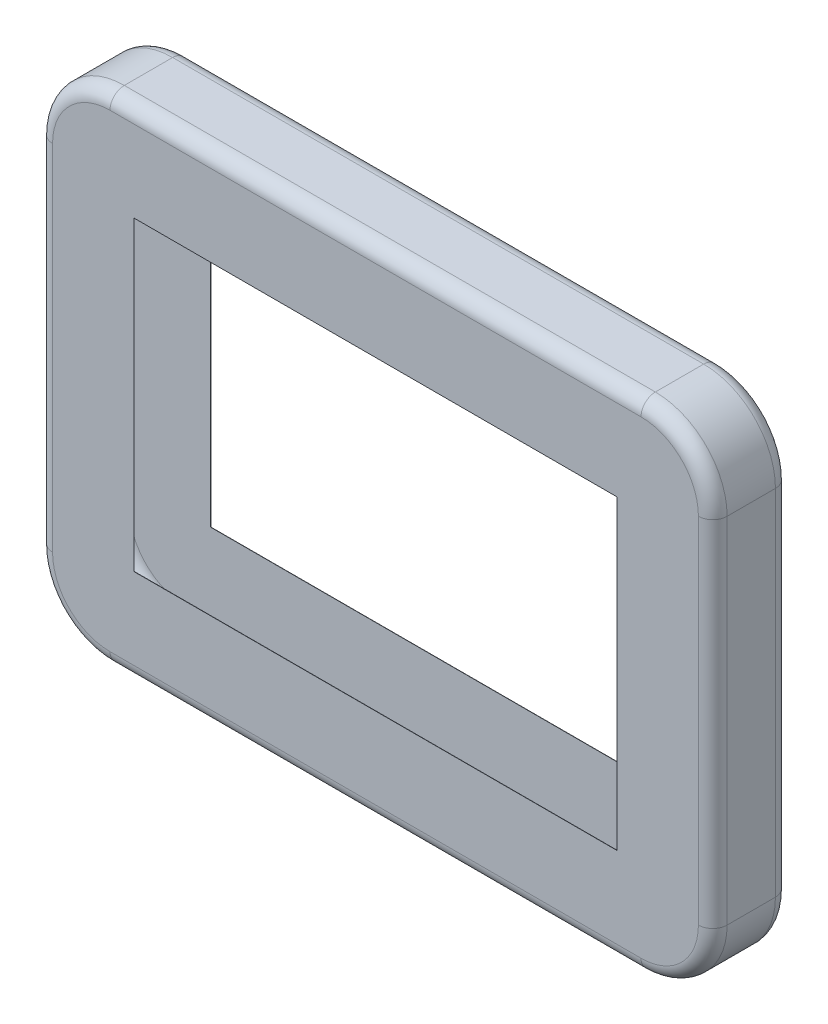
ISO-10303-21;
HEADER;
FILE_DESCRIPTION(('STEP AP214'),'2;1');
FILE_NAME('part.step','',(''),(''),'','','');
FILE_SCHEMA(('AUTOMOTIVE_DESIGN { 1 0 10303 214 1 1 1 1 }'));
ENDSEC;
DATA;
#1=APPLICATION_CONTEXT('core data for automotive mechanical design processes');
#2=APPLICATION_PROTOCOL_DEFINITION('international standard','automotive_design',2000,#1);
#3=PRODUCT_CONTEXT('',#1,'mechanical');
#4=PRODUCT('Part','Part','',(#3));
#5=PRODUCT_RELATED_PRODUCT_CATEGORY('part','',(#4));
#6=PRODUCT_DEFINITION_FORMATION('','',#4);
#7=PRODUCT_DEFINITION_CONTEXT('part definition',#1,'design');
#8=PRODUCT_DEFINITION('design','',#6,#7);
#9=PRODUCT_DEFINITION_SHAPE('','',#8);
#10=(LENGTH_UNIT() NAMED_UNIT(*) SI_UNIT(.MILLI.,.METRE.));
#11=(NAMED_UNIT(*) PLANE_ANGLE_UNIT() SI_UNIT($,.RADIAN.));
#12=(NAMED_UNIT(*) SI_UNIT($,.STERADIAN.) SOLID_ANGLE_UNIT());
#13=UNCERTAINTY_MEASURE_WITH_UNIT(LENGTH_MEASURE(1.E-05),#10,'distance_accuracy_value','');
#14=(GEOMETRIC_REPRESENTATION_CONTEXT(3) GLOBAL_UNCERTAINTY_ASSIGNED_CONTEXT((#13)) GLOBAL_UNIT_ASSIGNED_CONTEXT((#10,
#11,#12)) REPRESENTATION_CONTEXT('',''));
#15=CARTESIAN_POINT('',(0.,0.,0.));
#16=DIRECTION('',(0.,0.,1.));
#17=DIRECTION('',(1.,0.,0.));
#18=AXIS2_PLACEMENT_3D('',#15,#16,#17);
#19=CARTESIAN_POINT('',(-101.,73.9999999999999,32.2));
#20=DIRECTION('',(1.,0.,0.));
#21=DIRECTION('',(0.,1.,0.));
#22=AXIS2_PLACEMENT_3D('',#19,#20,#21);
#23=PLANE('',#22);
#24=DIRECTION('',(0.,0.,-1.));
#25=VECTOR('',#24,1.);
#26=CARTESIAN_POINT('',(-101.,64.,32.2));
#27=LINE('',#26,#25);
#28=CARTESIAN_POINT('',(-101.,64.,0.100000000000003));
#29=VERTEX_POINT('',#28);
#30=CARTESIAN_POINT('',(-101.,64.,0.));
#31=VERTEX_POINT('',#30);
#32=EDGE_CURVE('E736',#29,#31,#27,.T.);
#33=ORIENTED_EDGE('',*,*,#32,.F.);
#34=DIRECTION('',(0.,-1.,0.));
#35=VECTOR('',#34,1.);
#36=CARTESIAN_POINT('',(-101.,73.9999999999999,0.100000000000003));
#37=LINE('',#36,#35);
#38=CARTESIAN_POINT('',(-101.,-64.,0.100000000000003));
#39=VERTEX_POINT('',#38);
#40=EDGE_CURVE('E262',#29,#39,#37,.T.);
#41=ORIENTED_EDGE('',*,*,#40,.T.);
#42=DIRECTION('',(0.,0.,-1.));
#43=VECTOR('',#42,1.);
#44=CARTESIAN_POINT('',(-101.,-64.,32.2));
#45=LINE('',#44,#43);
#46=CARTESIAN_POINT('',(-101.,-64.,0.));
#47=VERTEX_POINT('',#46);
#48=EDGE_CURVE('E748',#39,#47,#45,.T.);
#49=ORIENTED_EDGE('',*,*,#48,.T.);
#50=DIRECTION('',(0.,-1.,0.));
#51=VECTOR('',#50,1.);
#52=CARTESIAN_POINT('',(-101.,73.9999999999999,0.));
#53=LINE('',#52,#51);
#54=EDGE_CURVE('E715',#31,#47,#53,.T.);
#55=ORIENTED_EDGE('',*,*,#54,.F.);
#56=EDGE_LOOP('',(#33,#41,#49,#55));
#57=FACE_BOUND('',#56,.T.);
#58=ADVANCED_FACE('F247',(#57),#23,.T.);
#59=CARTESIAN_POINT('',(-111.,-64.,32.2));
#60=DIRECTION('',(0.,1.,0.));
#61=DIRECTION('',(0.,0.,1.));
#62=AXIS2_PLACEMENT_3D('',#59,#60,#61);
#63=PLANE('',#62);
#64=ORIENTED_EDGE('',*,*,#48,.F.);
#65=DIRECTION('',(1.,0.,0.));
#66=VECTOR('',#65,1.);
#67=CARTESIAN_POINT('',(-111.,-64.,0.100000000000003));
#68=LINE('',#67,#66);
#69=CARTESIAN_POINT('',(101.,-64.,0.100000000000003));
#70=VERTEX_POINT('',#69);
#71=EDGE_CURVE('E665',#39,#70,#68,.T.);
#72=ORIENTED_EDGE('',*,*,#71,.T.);
#73=DIRECTION('',(0.,0.,-1.));
#74=VECTOR('',#73,1.);
#75=CARTESIAN_POINT('',(101.,-64.,32.2));
#76=LINE('',#75,#74);
#77=CARTESIAN_POINT('',(101.,-64.,0.));
#78=VERTEX_POINT('',#77);
#79=EDGE_CURVE('E744',#70,#78,#76,.T.);
#80=ORIENTED_EDGE('',*,*,#79,.T.);
#81=DIRECTION('',(1.,0.,0.));
#82=VECTOR('',#81,1.);
#83=CARTESIAN_POINT('',(-111.,-64.,0.));
#84=LINE('',#83,#82);
#85=EDGE_CURVE('E718',#47,#78,#84,.T.);
#86=ORIENTED_EDGE('',*,*,#85,.F.);
#87=EDGE_LOOP('',(#64,#72,#80,#86));
#88=FACE_BOUND('',#87,.T.);
#89=ADVANCED_FACE('F956',(#88),#63,.T.);
#90=CARTESIAN_POINT('',(101.,73.9999999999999,32.2));
#91=DIRECTION('',(-1.,0.,0.));
#92=DIRECTION('',(0.,-1.,0.));
#93=AXIS2_PLACEMENT_3D('',#90,#91,#92);
#94=PLANE('',#93);
#95=ORIENTED_EDGE('',*,*,#79,.F.);
#96=DIRECTION('',(0.,1.,0.));
#97=VECTOR('',#96,1.);
#98=CARTESIAN_POINT('',(101.,73.9999999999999,0.100000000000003));
#99=LINE('',#98,#97);
#100=CARTESIAN_POINT('',(101.,64.,0.100000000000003));
#101=VERTEX_POINT('',#100);
#102=EDGE_CURVE('E667',#70,#101,#99,.T.);
#103=ORIENTED_EDGE('',*,*,#102,.T.);
#104=DIRECTION('',(0.,0.,-1.));
#105=VECTOR('',#104,1.);
#106=CARTESIAN_POINT('',(101.,64.,32.2));
#107=LINE('',#106,#105);
#108=CARTESIAN_POINT('',(101.,64.,0.));
#109=VERTEX_POINT('',#108);
#110=EDGE_CURVE('E740',#101,#109,#107,.T.);
#111=ORIENTED_EDGE('',*,*,#110,.T.);
#112=DIRECTION('',(0.,1.,0.));
#113=VECTOR('',#112,1.);
#114=CARTESIAN_POINT('',(101.,73.9999999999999,0.));
#115=LINE('',#114,#113);
#116=EDGE_CURVE('E721',#78,#109,#115,.T.);
#117=ORIENTED_EDGE('',*,*,#116,.F.);
#118=EDGE_LOOP('',(#95,#103,#111,#117));
#119=FACE_BOUND('',#118,.T.);
#120=ADVANCED_FACE('F963',(#119),#94,.T.);
#121=CARTESIAN_POINT('',(-111.,64.,32.2));
#122=DIRECTION('',(0.,-1.,0.));
#123=DIRECTION('',(0.,0.,-1.));
#124=AXIS2_PLACEMENT_3D('',#121,#122,#123);
#125=PLANE('',#124);
#126=ORIENTED_EDGE('',*,*,#110,.F.);
#127=DIRECTION('',(-1.,0.,0.));
#128=VECTOR('',#127,1.);
#129=CARTESIAN_POINT('',(-111.,64.,0.100000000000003));
#130=LINE('',#129,#128);
#131=EDGE_CURVE('E663',#101,#29,#130,.T.);
#132=ORIENTED_EDGE('',*,*,#131,.T.);
#133=ORIENTED_EDGE('',*,*,#32,.T.);
#134=DIRECTION('',(-1.,0.,0.));
#135=VECTOR('',#134,1.);
#136=CARTESIAN_POINT('',(-111.,64.,0.));
#137=LINE('',#136,#135);
#138=EDGE_CURVE('E724',#109,#31,#137,.T.);
#139=ORIENTED_EDGE('',*,*,#138,.F.);
#140=EDGE_LOOP('',(#126,#132,#133,#139));
#141=FACE_BOUND('',#140,.T.);
#142=ADVANCED_FACE('F996',(#141),#125,.T.);
#143=CARTESIAN_POINT('',(-111.,74.,32.2));
#144=DIRECTION('',(0.,0.,1.));
#145=DIRECTION('',(1.,0.,0.));
#146=AXIS2_PLACEMENT_3D('',#143,#144,#145);
#147=PLANE('',#146);
#148=CARTESIAN_POINT('',(-111.,74.,32.2));
#149=DIRECTION('',(0.,0.,1.));
#150=DIRECTION('',(1.,0.,0.));
#151=AXIS2_PLACEMENT_3D('',#148,#149,#150);
#152=CIRCLE('',#151,24.);
#153=CARTESIAN_POINT('',(-111.,98.,32.2));
#154=VERTEX_POINT('',#153);
#155=CARTESIAN_POINT('',(-135.,73.9999999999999,32.2));
#156=VERTEX_POINT('',#155);
#157=EDGE_CURVE('E776',#154,#156,#152,.T.);
#158=ORIENTED_EDGE('',*,*,#157,.T.);
#159=DIRECTION('',(0.,-1.,0.));
#160=VECTOR('',#159,1.);
#161=CARTESIAN_POINT('',(-135.,-73.9999999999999,32.2));
#162=LINE('',#161,#160);
#163=CARTESIAN_POINT('',(-135.,-73.9999999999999,32.2));
#164=VERTEX_POINT('',#163);
#165=EDGE_CURVE('E790',#156,#164,#162,.T.);
#166=ORIENTED_EDGE('',*,*,#165,.T.);
#167=CARTESIAN_POINT('',(-111.,-74.,32.2));
#168=DIRECTION('',(0.,0.,1.));
#169=DIRECTION('',(1.,0.,0.));
#170=AXIS2_PLACEMENT_3D('',#167,#168,#169);
#171=CIRCLE('',#170,24.);
#172=CARTESIAN_POINT('',(-111.,-98.,32.2));
#173=VERTEX_POINT('',#172);
#174=EDGE_CURVE('E788',#164,#173,#171,.T.);
#175=ORIENTED_EDGE('',*,*,#174,.T.);
#176=DIRECTION('',(1.,0.,0.));
#177=VECTOR('',#176,1.);
#178=CARTESIAN_POINT('',(111.,-98.,32.2));
#179=LINE('',#178,#177);
#180=CARTESIAN_POINT('',(111.,-98.,32.2));
#181=VERTEX_POINT('',#180);
#182=EDGE_CURVE('E786',#173,#181,#179,.T.);
#183=ORIENTED_EDGE('',*,*,#182,.T.);
#184=CARTESIAN_POINT('',(111.,-74.,32.2));
#185=DIRECTION('',(0.,0.,1.));
#186=DIRECTION('',(1.,0.,0.));
#187=AXIS2_PLACEMENT_3D('',#184,#185,#186);
#188=CIRCLE('',#187,24.);
#189=CARTESIAN_POINT('',(135.,-73.9999999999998,32.2));
#190=VERTEX_POINT('',#189);
#191=EDGE_CURVE('E784',#181,#190,#188,.T.);
#192=ORIENTED_EDGE('',*,*,#191,.T.);
#193=DIRECTION('',(0.,1.,0.));
#194=VECTOR('',#193,1.);
#195=CARTESIAN_POINT('',(135.,73.9999999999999,32.2));
#196=LINE('',#195,#194);
#197=CARTESIAN_POINT('',(135.,73.9999999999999,32.2));
#198=VERTEX_POINT('',#197);
#199=EDGE_CURVE('E782',#190,#198,#196,.T.);
#200=ORIENTED_EDGE('',*,*,#199,.T.);
#201=CARTESIAN_POINT('',(111.,74.,32.2));
#202=DIRECTION('',(0.,0.,1.));
#203=DIRECTION('',(1.,0.,0.));
#204=AXIS2_PLACEMENT_3D('',#201,#202,#203);
#205=CIRCLE('',#204,24.);
#206=CARTESIAN_POINT('',(111.,98.,32.2));
#207=VERTEX_POINT('',#206);
#208=EDGE_CURVE('E780',#198,#207,#205,.T.);
#209=ORIENTED_EDGE('',*,*,#208,.T.);
#210=DIRECTION('',(-1.,0.,0.));
#211=VECTOR('',#210,1.);
#212=CARTESIAN_POINT('',(-111.,98.,32.2));
#213=LINE('',#212,#211);
#214=EDGE_CURVE('E778',#207,#154,#213,.T.);
#215=ORIENTED_EDGE('',*,*,#214,.T.);
#216=EDGE_LOOP('',(#158,#166,#175,#183,#192,#200,#209,#215));
#217=FACE_BOUND('',#216,.T.);
#218=DIRECTION('',(1.,0.,0.));
#219=VECTOR('',#218,1.);
#220=CARTESIAN_POINT('',(-111.,-64.,32.2));
#221=LINE('',#220,#219);
#222=CARTESIAN_POINT('',(-101.,-64.,32.2));
#223=VERTEX_POINT('',#222);
#224=CARTESIAN_POINT('',(101.,-64.,32.2));
#225=VERTEX_POINT('',#224);
#226=EDGE_CURVE('E729',#223,#225,#221,.T.);
#227=ORIENTED_EDGE('',*,*,#226,.F.);
#228=DIRECTION('',(0.,-1.,0.));
#229=VECTOR('',#228,1.);
#230=CARTESIAN_POINT('',(-101.,73.9999999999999,32.2));
#231=LINE('',#230,#229);
#232=CARTESIAN_POINT('',(-101.,64.,32.2));
#233=VERTEX_POINT('',#232);
#234=EDGE_CURVE('E727',#233,#223,#231,.T.);
#235=ORIENTED_EDGE('',*,*,#234,.F.);
#236=DIRECTION('',(-1.,0.,0.));
#237=VECTOR('',#236,1.);
#238=CARTESIAN_POINT('',(-111.,64.,32.2));
#239=LINE('',#238,#237);
#240=CARTESIAN_POINT('',(101.,64.,32.2));
#241=VERTEX_POINT('',#240);
#242=EDGE_CURVE('E734',#241,#233,#239,.T.);
#243=ORIENTED_EDGE('',*,*,#242,.F.);
#244=DIRECTION('',(0.,1.,0.));
#245=VECTOR('',#244,1.);
#246=CARTESIAN_POINT('',(101.,73.9999999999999,32.2));
#247=LINE('',#246,#245);
#248=EDGE_CURVE('E731',#225,#241,#247,.T.);
#249=ORIENTED_EDGE('',*,*,#248,.F.);
#250=EDGE_LOOP('',(#227,#235,#243,#249));
#251=FACE_BOUND('',#250,.T.);
#252=ADVANCED_FACE('F919',(#217,#251),#147,.T.);
#253=CARTESIAN_POINT('',(-111.,74.,0.));
#254=DIRECTION('',(0.,0.,1.));
#255=DIRECTION('',(1.,0.,0.));
#256=AXIS2_PLACEMENT_3D('',#253,#254,#255);
#257=PLANE('',#256);
#258=CARTESIAN_POINT('',(-111.,-74.,0.));
#259=DIRECTION('',(0.,0.,1.));
#260=DIRECTION('',(1.,0.,0.));
#261=AXIS2_PLACEMENT_3D('',#258,#259,#260);
#262=CIRCLE('',#261,24.);
#263=CARTESIAN_POINT('',(-111.,-98.,0.));
#264=VERTEX_POINT('',#263);
#265=CARTESIAN_POINT('',(-135.,-73.9999999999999,0.));
#266=VERTEX_POINT('',#265);
#267=EDGE_CURVE('E255',#264,#266,#262,.F.);
#268=ORIENTED_EDGE('',*,*,#267,.T.);
#269=DIRECTION('',(0.,-1.,0.));
#270=VECTOR('',#269,1.);
#271=CARTESIAN_POINT('',(-135.,74.,0.));
#272=LINE('',#271,#270);
#273=CARTESIAN_POINT('',(-135.,73.9999999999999,0.));
#274=VERTEX_POINT('',#273);
#275=EDGE_CURVE('E12',#266,#274,#272,.F.);
#276=ORIENTED_EDGE('',*,*,#275,.T.);
#277=CARTESIAN_POINT('',(-111.,74.,0.));
#278=DIRECTION('',(0.,0.,1.));
#279=DIRECTION('',(1.,0.,0.));
#280=AXIS2_PLACEMENT_3D('',#277,#278,#279);
#281=CIRCLE('',#280,24.);
#282=CARTESIAN_POINT('',(-111.,98.,0.));
#283=VERTEX_POINT('',#282);
#284=EDGE_CURVE('E827',#274,#283,#281,.F.);
#285=ORIENTED_EDGE('',*,*,#284,.T.);
#286=DIRECTION('',(-1.,0.,0.));
#287=VECTOR('',#286,1.);
#288=CARTESIAN_POINT('',(-111.,98.,0.));
#289=LINE('',#288,#287);
#290=CARTESIAN_POINT('',(111.,98.,0.));
#291=VERTEX_POINT('',#290);
#292=EDGE_CURVE('E829',#283,#291,#289,.F.);
#293=ORIENTED_EDGE('',*,*,#292,.T.);
#294=CARTESIAN_POINT('',(111.,74.,0.));
#295=DIRECTION('',(0.,0.,1.));
#296=DIRECTION('',(1.,0.,0.));
#297=AXIS2_PLACEMENT_3D('',#294,#295,#296);
#298=CIRCLE('',#297,24.);
#299=CARTESIAN_POINT('',(135.,73.9999999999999,0.));
#300=VERTEX_POINT('',#299);
#301=EDGE_CURVE('E831',#291,#300,#298,.F.);
#302=ORIENTED_EDGE('',*,*,#301,.T.);
#303=DIRECTION('',(0.,1.,0.));
#304=VECTOR('',#303,1.);
#305=CARTESIAN_POINT('',(135.,74.0000000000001,0.));
#306=LINE('',#305,#304);
#307=CARTESIAN_POINT('',(135.,-73.9999999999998,0.));
#308=VERTEX_POINT('',#307);
#309=EDGE_CURVE('E833',#300,#308,#306,.F.);
#310=ORIENTED_EDGE('',*,*,#309,.T.);
#311=CARTESIAN_POINT('',(111.,-74.,0.));
#312=DIRECTION('',(0.,0.,1.));
#313=DIRECTION('',(1.,0.,0.));
#314=AXIS2_PLACEMENT_3D('',#311,#312,#313);
#315=CIRCLE('',#314,24.);
#316=CARTESIAN_POINT('',(111.,-98.,0.));
#317=VERTEX_POINT('',#316);
#318=EDGE_CURVE('E835',#308,#317,#315,.F.);
#319=ORIENTED_EDGE('',*,*,#318,.T.);
#320=DIRECTION('',(1.,0.,0.));
#321=VECTOR('',#320,1.);
#322=CARTESIAN_POINT('',(-111.,-98.,0.));
#323=LINE('',#322,#321);
#324=EDGE_CURVE('E837',#317,#264,#323,.F.);
#325=ORIENTED_EDGE('',*,*,#324,.T.);
#326=EDGE_LOOP('',(#268,#276,#285,#293,#302,#310,#319,#325));
#327=FACE_BOUND('',#326,.T.);
#328=ORIENTED_EDGE('',*,*,#54,.T.);
#329=ORIENTED_EDGE('',*,*,#85,.T.);
#330=ORIENTED_EDGE('',*,*,#116,.T.);
#331=ORIENTED_EDGE('',*,*,#138,.T.);
#332=EDGE_LOOP('',(#328,#329,#330,#331));
#333=FACE_BOUND('',#332,.T.);
#334=ADVANCED_FACE('F841',(#327,#333),#257,.F.);
#335=CARTESIAN_POINT('',(-111.,74.,32.2));
#336=DIRECTION('',(0.,0.,-1.));
#337=DIRECTION('',(-1.,0.,0.));
#338=AXIS2_PLACEMENT_3D('',#335,#336,#337);
#339=CYLINDRICAL_SURFACE('',#338,30.);
#340=DIRECTION('',(0.,0.,-1.));
#341=VECTOR('',#340,1.);
#342=CARTESIAN_POINT('',(-141.,73.9999999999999,32.2));
#343=LINE('',#342,#341);
#344=CARTESIAN_POINT('',(-141.,73.9999999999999,26.2));
#345=VERTEX_POINT('',#344);
#346=CARTESIAN_POINT('',(-141.,73.9999999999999,6.));
#347=VERTEX_POINT('',#346);
#348=EDGE_CURVE('E773',#345,#347,#343,.T.);
#349=ORIENTED_EDGE('',*,*,#348,.F.);
#350=CARTESIAN_POINT('',(-111.,74.,26.2));
#351=DIRECTION('',(0.,0.,1.));
#352=DIRECTION('',(1.,0.,0.));
#353=AXIS2_PLACEMENT_3D('',#350,#351,#352);
#354=CIRCLE('',#353,30.);
#355=CARTESIAN_POINT('',(-111.,104.,26.2));
#356=VERTEX_POINT('',#355);
#357=EDGE_CURVE('E825',#345,#356,#354,.F.);
#358=ORIENTED_EDGE('',*,*,#357,.T.);
#359=DIRECTION('',(0.,0.,-1.));
#360=VECTOR('',#359,1.);
#361=CARTESIAN_POINT('',(-111.,104.,32.2));
#362=LINE('',#361,#360);
#363=CARTESIAN_POINT('',(-111.,104.,6.));
#364=VERTEX_POINT('',#363);
#365=EDGE_CURVE('E752',#356,#364,#362,.T.);
#366=ORIENTED_EDGE('',*,*,#365,.T.);
#367=CARTESIAN_POINT('',(-111.,74.,6.));
#368=DIRECTION('',(0.,0.,1.));
#369=DIRECTION('',(1.,0.,0.));
#370=AXIS2_PLACEMENT_3D('',#367,#368,#369);
#371=CIRCLE('',#370,30.);
#372=EDGE_CURVE('E823',#364,#347,#371,.T.);
#373=ORIENTED_EDGE('',*,*,#372,.T.);
#374=EDGE_LOOP('',(#349,#358,#366,#373));
#375=FACE_BOUND('',#374,.T.);
#376=ADVANCED_FACE('F249',(#375),#339,.T.);
#377=CARTESIAN_POINT('',(-141.,73.9999999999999,32.2));
#378=DIRECTION('',(1.,0.,0.));
#379=DIRECTION('',(0.,1.,0.));
#380=AXIS2_PLACEMENT_3D('',#377,#378,#379);
#381=PLANE('',#380);
#382=DIRECTION('',(0.,0.,-1.));
#383=VECTOR('',#382,1.);
#384=CARTESIAN_POINT('',(-141.,-73.9999999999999,32.2));
#385=LINE('',#384,#383);
#386=CARTESIAN_POINT('',(-141.,-73.9999999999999,26.2));
#387=VERTEX_POINT('',#386);
#388=CARTESIAN_POINT('',(-141.,-73.9999999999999,6.));
#389=VERTEX_POINT('',#388);
#390=EDGE_CURVE('E770',#387,#389,#385,.T.);
#391=ORIENTED_EDGE('',*,*,#390,.F.);
#392=DIRECTION('',(0.,-1.,0.));
#393=VECTOR('',#392,1.);
#394=CARTESIAN_POINT('',(-141.,73.9999999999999,26.2));
#395=LINE('',#394,#393);
#396=EDGE_CURVE('E796',#387,#345,#395,.F.);
#397=ORIENTED_EDGE('',*,*,#396,.T.);
#398=ORIENTED_EDGE('',*,*,#348,.T.);
#399=DIRECTION('',(0.,-1.,0.));
#400=VECTOR('',#399,1.);
#401=CARTESIAN_POINT('',(-141.,73.9999999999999,6.));
#402=LINE('',#401,#400);
#403=EDGE_CURVE('E793',#347,#389,#402,.T.);
#404=ORIENTED_EDGE('',*,*,#403,.T.);
#405=EDGE_LOOP('',(#391,#397,#398,#404));
#406=FACE_BOUND('',#405,.T.);
#407=ADVANCED_FACE('F858',(#406),#381,.F.);
#408=CARTESIAN_POINT('',(-111.,-74.,32.2));
#409=DIRECTION('',(0.,0.,-1.));
#410=DIRECTION('',(-1.,0.,0.));
#411=AXIS2_PLACEMENT_3D('',#408,#409,#410);
#412=CYLINDRICAL_SURFACE('',#411,30.);
#413=DIRECTION('',(0.,0.,-1.));
#414=VECTOR('',#413,1.);
#415=CARTESIAN_POINT('',(-111.,-104.,32.2));
#416=LINE('',#415,#414);
#417=CARTESIAN_POINT('',(-111.,-104.,26.2));
#418=VERTEX_POINT('',#417);
#419=CARTESIAN_POINT('',(-111.,-104.,6.));
#420=VERTEX_POINT('',#419);
#421=EDGE_CURVE('E767',#418,#420,#416,.T.);
#422=ORIENTED_EDGE('',*,*,#421,.F.);
#423=CARTESIAN_POINT('',(-111.,-74.,26.2));
#424=DIRECTION('',(0.,0.,1.));
#425=DIRECTION('',(1.,0.,0.));
#426=AXIS2_PLACEMENT_3D('',#423,#424,#425);
#427=CIRCLE('',#426,30.);
#428=EDGE_CURVE('E801',#418,#387,#427,.F.);
#429=ORIENTED_EDGE('',*,*,#428,.T.);
#430=ORIENTED_EDGE('',*,*,#390,.T.);
#431=CARTESIAN_POINT('',(-111.,-74.,6.));
#432=DIRECTION('',(0.,0.,1.));
#433=DIRECTION('',(1.,0.,0.));
#434=AXIS2_PLACEMENT_3D('',#431,#432,#433);
#435=CIRCLE('',#434,30.);
#436=EDGE_CURVE('E799',#389,#420,#435,.T.);
#437=ORIENTED_EDGE('',*,*,#436,.T.);
#438=EDGE_LOOP('',(#422,#429,#430,#437));
#439=FACE_BOUND('',#438,.T.);
#440=ADVANCED_FACE('F861',(#439),#412,.T.);
#441=CARTESIAN_POINT('',(-111.,-104.,32.2));
#442=DIRECTION('',(0.,1.,0.));
#443=DIRECTION('',(0.,0.,1.));
#444=AXIS2_PLACEMENT_3D('',#441,#442,#443);
#445=PLANE('',#444);
#446=DIRECTION('',(0.,0.,-1.));
#447=VECTOR('',#446,1.);
#448=CARTESIAN_POINT('',(111.,-104.,32.2));
#449=LINE('',#448,#447);
#450=CARTESIAN_POINT('',(111.,-104.,26.2));
#451=VERTEX_POINT('',#450);
#452=CARTESIAN_POINT('',(111.,-104.,6.));
#453=VERTEX_POINT('',#452);
#454=EDGE_CURVE('E764',#451,#453,#449,.T.);
#455=ORIENTED_EDGE('',*,*,#454,.F.);
#456=DIRECTION('',(1.,0.,0.));
#457=VECTOR('',#456,1.);
#458=CARTESIAN_POINT('',(-111.,-104.,26.2));
#459=LINE('',#458,#457);
#460=EDGE_CURVE('E805',#451,#418,#459,.F.);
#461=ORIENTED_EDGE('',*,*,#460,.T.);
#462=ORIENTED_EDGE('',*,*,#421,.T.);
#463=DIRECTION('',(1.,0.,0.));
#464=VECTOR('',#463,1.);
#465=CARTESIAN_POINT('',(-111.,-104.,6.));
#466=LINE('',#465,#464);
#467=EDGE_CURVE('E803',#420,#453,#466,.T.);
#468=ORIENTED_EDGE('',*,*,#467,.T.);
#469=EDGE_LOOP('',(#455,#461,#462,#468));
#470=FACE_BOUND('',#469,.T.);
#471=ADVANCED_FACE('F904',(#470),#445,.F.);
#472=CARTESIAN_POINT('',(111.,-74.,32.2));
#473=DIRECTION('',(0.,0.,-1.));
#474=DIRECTION('',(-1.,0.,0.));
#475=AXIS2_PLACEMENT_3D('',#472,#473,#474);
#476=CYLINDRICAL_SURFACE('',#475,30.);
#477=DIRECTION('',(0.,0.,-1.));
#478=VECTOR('',#477,1.);
#479=CARTESIAN_POINT('',(141.,-73.9999999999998,32.2));
#480=LINE('',#479,#478);
#481=CARTESIAN_POINT('',(141.,-73.9999999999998,26.2));
#482=VERTEX_POINT('',#481);
#483=CARTESIAN_POINT('',(141.,-73.9999999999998,6.));
#484=VERTEX_POINT('',#483);
#485=EDGE_CURVE('E761',#482,#484,#480,.T.);
#486=ORIENTED_EDGE('',*,*,#485,.F.);
#487=CARTESIAN_POINT('',(111.,-74.,26.2));
#488=DIRECTION('',(0.,0.,1.));
#489=DIRECTION('',(1.,0.,0.));
#490=AXIS2_PLACEMENT_3D('',#487,#488,#489);
#491=CIRCLE('',#490,30.);
#492=EDGE_CURVE('E809',#482,#451,#491,.F.);
#493=ORIENTED_EDGE('',*,*,#492,.T.);
#494=ORIENTED_EDGE('',*,*,#454,.T.);
#495=CARTESIAN_POINT('',(111.,-74.,6.));
#496=DIRECTION('',(0.,0.,1.));
#497=DIRECTION('',(1.,0.,0.));
#498=AXIS2_PLACEMENT_3D('',#495,#496,#497);
#499=CIRCLE('',#498,30.);
#500=EDGE_CURVE('E807',#453,#484,#499,.T.);
#501=ORIENTED_EDGE('',*,*,#500,.T.);
#502=EDGE_LOOP('',(#486,#493,#494,#501));
#503=FACE_BOUND('',#502,.T.);
#504=ADVANCED_FACE('F908',(#503),#476,.T.);
#505=CARTESIAN_POINT('',(141.,73.9999999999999,32.2));
#506=DIRECTION('',(-1.,0.,0.));
#507=DIRECTION('',(0.,-1.,0.));
#508=AXIS2_PLACEMENT_3D('',#505,#506,#507);
#509=PLANE('',#508);
#510=DIRECTION('',(0.,0.,-1.));
#511=VECTOR('',#510,1.);
#512=CARTESIAN_POINT('',(141.,73.9999999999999,32.2));
#513=LINE('',#512,#511);
#514=CARTESIAN_POINT('',(141.,73.9999999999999,26.2));
#515=VERTEX_POINT('',#514);
#516=CARTESIAN_POINT('',(141.,73.9999999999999,6.));
#517=VERTEX_POINT('',#516);
#518=EDGE_CURVE('E758',#515,#517,#513,.T.);
#519=ORIENTED_EDGE('',*,*,#518,.F.);
#520=DIRECTION('',(0.,1.,0.));
#521=VECTOR('',#520,1.);
#522=CARTESIAN_POINT('',(141.,-73.9999999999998,26.2));
#523=LINE('',#522,#521);
#524=EDGE_CURVE('E813',#515,#482,#523,.F.);
#525=ORIENTED_EDGE('',*,*,#524,.T.);
#526=ORIENTED_EDGE('',*,*,#485,.T.);
#527=DIRECTION('',(0.,1.,0.));
#528=VECTOR('',#527,1.);
#529=CARTESIAN_POINT('',(141.,73.9999999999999,6.));
#530=LINE('',#529,#528);
#531=EDGE_CURVE('E811',#484,#517,#530,.T.);
#532=ORIENTED_EDGE('',*,*,#531,.T.);
#533=EDGE_LOOP('',(#519,#525,#526,#532));
#534=FACE_BOUND('',#533,.T.);
#535=ADVANCED_FACE('F946',(#534),#509,.F.);
#536=CARTESIAN_POINT('',(111.,74.,32.2));
#537=DIRECTION('',(0.,0.,-1.));
#538=DIRECTION('',(-1.,0.,0.));
#539=AXIS2_PLACEMENT_3D('',#536,#537,#538);
#540=CYLINDRICAL_SURFACE('',#539,30.);
#541=DIRECTION('',(0.,0.,-1.));
#542=VECTOR('',#541,1.);
#543=CARTESIAN_POINT('',(111.,104.,32.2));
#544=LINE('',#543,#542);
#545=CARTESIAN_POINT('',(111.,104.,26.2));
#546=VERTEX_POINT('',#545);
#547=CARTESIAN_POINT('',(111.,104.,6.));
#548=VERTEX_POINT('',#547);
#549=EDGE_CURVE('E755',#546,#548,#544,.T.);
#550=ORIENTED_EDGE('',*,*,#549,.F.);
#551=CARTESIAN_POINT('',(111.,74.,26.2));
#552=DIRECTION('',(0.,0.,1.));
#553=DIRECTION('',(1.,0.,0.));
#554=AXIS2_PLACEMENT_3D('',#551,#552,#553);
#555=CIRCLE('',#554,30.);
#556=EDGE_CURVE('E817',#546,#515,#555,.F.);
#557=ORIENTED_EDGE('',*,*,#556,.T.);
#558=ORIENTED_EDGE('',*,*,#518,.T.);
#559=CARTESIAN_POINT('',(111.,74.,6.));
#560=DIRECTION('',(0.,0.,1.));
#561=DIRECTION('',(1.,0.,0.));
#562=AXIS2_PLACEMENT_3D('',#559,#560,#561);
#563=CIRCLE('',#562,30.);
#564=EDGE_CURVE('E815',#517,#548,#563,.T.);
#565=ORIENTED_EDGE('',*,*,#564,.T.);
#566=EDGE_LOOP('',(#550,#557,#558,#565));
#567=FACE_BOUND('',#566,.T.);
#568=ADVANCED_FACE('F936',(#567),#540,.T.);
#569=CARTESIAN_POINT('',(-111.,104.,32.2));
#570=DIRECTION('',(0.,-1.,0.));
#571=DIRECTION('',(0.,0.,-1.));
#572=AXIS2_PLACEMENT_3D('',#569,#570,#571);
#573=PLANE('',#572);
#574=ORIENTED_EDGE('',*,*,#365,.F.);
#575=DIRECTION('',(-1.,0.,0.));
#576=VECTOR('',#575,1.);
#577=CARTESIAN_POINT('',(111.,104.,26.2));
#578=LINE('',#577,#576);
#579=EDGE_CURVE('E821',#356,#546,#578,.F.);
#580=ORIENTED_EDGE('',*,*,#579,.T.);
#581=ORIENTED_EDGE('',*,*,#549,.T.);
#582=DIRECTION('',(-1.,0.,0.));
#583=VECTOR('',#582,1.);
#584=CARTESIAN_POINT('',(-111.,104.,6.));
#585=LINE('',#584,#583);
#586=EDGE_CURVE('E819',#548,#364,#585,.T.);
#587=ORIENTED_EDGE('',*,*,#586,.T.);
#588=EDGE_LOOP('',(#574,#580,#581,#587));
#589=FACE_BOUND('',#588,.T.);
#590=ADVANCED_FACE('F933',(#589),#573,.F.);
#591=DIRECTION('',(0.,-1.,0.));
#592=VECTOR('',#591,1.);
#593=CARTESIAN_POINT('',(-101.,73.9999999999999,32.1));
#594=LINE('',#593,#592);
#595=CARTESIAN_POINT('',(-101.,64.,32.1));
#596=VERTEX_POINT('',#595);
#597=CARTESIAN_POINT('',(-101.,-64.,32.1));
#598=VERTEX_POINT('',#597);
#599=EDGE_CURVE('E659',#596,#598,#594,.T.);
#600=ORIENTED_EDGE('',*,*,#599,.F.);
#601=EDGE_CURVE('E737',#233,#596,#27,.T.);
#602=ORIENTED_EDGE('',*,*,#601,.F.);
#603=ORIENTED_EDGE('',*,*,#234,.T.);
#604=EDGE_CURVE('E749',#223,#598,#45,.T.);
#605=ORIENTED_EDGE('',*,*,#604,.T.);
#606=EDGE_LOOP('',(#600,#602,#603,#605));
#607=FACE_BOUND('',#606,.T.);
#608=ADVANCED_FACE('F959',(#607),#23,.T.);
#609=DIRECTION('',(1.,0.,0.));
#610=VECTOR('',#609,1.);
#611=CARTESIAN_POINT('',(-111.,-64.,32.1));
#612=LINE('',#611,#610);
#613=CARTESIAN_POINT('',(101.,-64.,32.1));
#614=VERTEX_POINT('',#613);
#615=EDGE_CURVE('E657',#598,#614,#612,.T.);
#616=ORIENTED_EDGE('',*,*,#615,.F.);
#617=ORIENTED_EDGE('',*,*,#604,.F.);
#618=ORIENTED_EDGE('',*,*,#226,.T.);
#619=EDGE_CURVE('E745',#225,#614,#76,.T.);
#620=ORIENTED_EDGE('',*,*,#619,.T.);
#621=EDGE_LOOP('',(#616,#617,#618,#620));
#622=FACE_BOUND('',#621,.T.);
#623=ADVANCED_FACE('F966',(#622),#63,.T.);
#624=DIRECTION('',(0.,1.,0.));
#625=VECTOR('',#624,1.);
#626=CARTESIAN_POINT('',(101.,73.9999999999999,32.1));
#627=LINE('',#626,#625);
#628=CARTESIAN_POINT('',(101.,64.,32.1));
#629=VERTEX_POINT('',#628);
#630=EDGE_CURVE('E270',#614,#629,#627,.T.);
#631=ORIENTED_EDGE('',*,*,#630,.F.);
#632=ORIENTED_EDGE('',*,*,#619,.F.);
#633=ORIENTED_EDGE('',*,*,#248,.T.);
#634=EDGE_CURVE('E741',#241,#629,#107,.T.);
#635=ORIENTED_EDGE('',*,*,#634,.T.);
#636=EDGE_LOOP('',(#631,#632,#633,#635));
#637=FACE_BOUND('',#636,.T.);
#638=ADVANCED_FACE('F975',(#637),#94,.T.);
#639=DIRECTION('',(-1.,0.,0.));
#640=VECTOR('',#639,1.);
#641=CARTESIAN_POINT('',(-111.,64.,32.1));
#642=LINE('',#641,#640);
#643=EDGE_CURVE('E595',#629,#596,#642,.T.);
#644=ORIENTED_EDGE('',*,*,#643,.F.);
#645=ORIENTED_EDGE('',*,*,#634,.F.);
#646=ORIENTED_EDGE('',*,*,#242,.T.);
#647=ORIENTED_EDGE('',*,*,#601,.T.);
#648=EDGE_LOOP('',(#644,#645,#646,#647));
#649=FACE_BOUND('',#648,.T.);
#650=ADVANCED_FACE('F984',(#649),#125,.T.);
#651=CARTESIAN_POINT('',(135.,74.0000000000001,26.2));
#652=DIRECTION('',(0.,-1.,0.));
#653=DIRECTION('',(1.,0.,0.));
#654=AXIS2_PLACEMENT_3D('',#651,#652,#653);
#655=CYLINDRICAL_SURFACE('',#654,6.);
#656=CARTESIAN_POINT('',(135.,-73.9999999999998,26.2));
#657=DIRECTION('',(0.,-1.,0.));
#658=DIRECTION('',(0.,0.,-1.));
#659=AXIS2_PLACEMENT_3D('',#656,#657,#658);
#660=CIRCLE('',#659,6.);
#661=EDGE_CURVE('E709',#482,#190,#660,.T.);
#662=ORIENTED_EDGE('',*,*,#661,.F.);
#663=ORIENTED_EDGE('',*,*,#524,.F.);
#664=CARTESIAN_POINT('',(135.,73.9999999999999,26.2));
#665=DIRECTION('',(0.,1.,0.));
#666=DIRECTION('',(0.,0.,1.));
#667=AXIS2_PLACEMENT_3D('',#664,#665,#666);
#668=CIRCLE('',#667,6.);
#669=EDGE_CURVE('E712',#198,#515,#668,.T.);
#670=ORIENTED_EDGE('',*,*,#669,.F.);
#671=ORIENTED_EDGE('',*,*,#199,.F.);
#672=EDGE_LOOP('',(#662,#663,#670,#671));
#673=FACE_BOUND('',#672,.T.);
#674=ADVANCED_FACE('F944',(#673),#655,.T.);
#675=CARTESIAN_POINT('',(111.,74.,26.2));
#676=DIRECTION('',(0.,0.,1.));
#677=DIRECTION('',(1.,0.,0.));
#678=AXIS2_PLACEMENT_3D('',#675,#676,#677);
#679=TOROIDAL_SURFACE('',#678,24.,6.);
#680=ORIENTED_EDGE('',*,*,#669,.T.);
#681=ORIENTED_EDGE('',*,*,#556,.F.);
#682=CARTESIAN_POINT('',(111.,98.,26.2));
#683=DIRECTION('',(-1.,0.,0.));
#684=DIRECTION('',(0.,-1.,0.));
#685=AXIS2_PLACEMENT_3D('',#682,#683,#684);
#686=CIRCLE('',#685,6.);
#687=EDGE_CURVE('E706',#207,#546,#686,.T.);
#688=ORIENTED_EDGE('',*,*,#687,.F.);
#689=ORIENTED_EDGE('',*,*,#208,.F.);
#690=EDGE_LOOP('',(#680,#681,#688,#689));
#691=FACE_BOUND('',#690,.T.);
#692=ADVANCED_FACE('F939',(#691),#679,.T.);
#693=CARTESIAN_POINT('',(111.,-74.,26.2));
#694=DIRECTION('',(0.,0.,1.));
#695=DIRECTION('',(1.,0.,0.));
#696=AXIS2_PLACEMENT_3D('',#693,#694,#695);
#697=TOROIDAL_SURFACE('',#696,24.,6.);
#698=ORIENTED_EDGE('',*,*,#661,.T.);
#699=ORIENTED_EDGE('',*,*,#191,.F.);
#700=CARTESIAN_POINT('',(111.,-98.,26.2));
#701=DIRECTION('',(-1.,0.,0.));
#702=DIRECTION('',(0.,0.,1.));
#703=AXIS2_PLACEMENT_3D('',#700,#701,#702);
#704=CIRCLE('',#703,6.);
#705=EDGE_CURVE('E703',#451,#181,#704,.T.);
#706=ORIENTED_EDGE('',*,*,#705,.F.);
#707=ORIENTED_EDGE('',*,*,#492,.F.);
#708=EDGE_LOOP('',(#698,#699,#706,#707));
#709=FACE_BOUND('',#708,.T.);
#710=ADVANCED_FACE('F912',(#709),#697,.T.);
#711=CARTESIAN_POINT('',(-111.,98.,26.2));
#712=DIRECTION('',(1.,0.,0.));
#713=DIRECTION('',(0.,0.,-1.));
#714=AXIS2_PLACEMENT_3D('',#711,#712,#713);
#715=CYLINDRICAL_SURFACE('',#714,6.);
#716=ORIENTED_EDGE('',*,*,#687,.T.);
#717=ORIENTED_EDGE('',*,*,#579,.F.);
#718=CARTESIAN_POINT('',(-111.,98.,26.2));
#719=DIRECTION('',(-1.,0.,0.));
#720=DIRECTION('',(0.,0.,1.));
#721=AXIS2_PLACEMENT_3D('',#718,#719,#720);
#722=CIRCLE('',#721,6.);
#723=EDGE_CURVE('E700',#154,#356,#722,.T.);
#724=ORIENTED_EDGE('',*,*,#723,.F.);
#725=ORIENTED_EDGE('',*,*,#214,.F.);
#726=EDGE_LOOP('',(#716,#717,#724,#725));
#727=FACE_BOUND('',#726,.T.);
#728=ADVANCED_FACE('F929',(#727),#715,.T.);
#729=CARTESIAN_POINT('',(-111.,-98.,26.2));
#730=DIRECTION('',(-1.,0.,0.));
#731=DIRECTION('',(0.,0.,1.));
#732=AXIS2_PLACEMENT_3D('',#729,#730,#731);
#733=CYLINDRICAL_SURFACE('',#732,6.);
#734=ORIENTED_EDGE('',*,*,#705,.T.);
#735=ORIENTED_EDGE('',*,*,#182,.F.);
#736=CARTESIAN_POINT('',(-111.,-98.,26.2));
#737=DIRECTION('',(-1.,0.,0.));
#738=DIRECTION('',(0.,0.,1.));
#739=AXIS2_PLACEMENT_3D('',#736,#737,#738);
#740=CIRCLE('',#739,6.);
#741=EDGE_CURVE('E697',#418,#173,#740,.T.);
#742=ORIENTED_EDGE('',*,*,#741,.F.);
#743=ORIENTED_EDGE('',*,*,#460,.F.);
#744=EDGE_LOOP('',(#734,#735,#742,#743));
#745=FACE_BOUND('',#744,.T.);
#746=ADVANCED_FACE('F917',(#745),#733,.T.);
#747=CARTESIAN_POINT('',(-111.,74.,26.2));
#748=DIRECTION('',(0.,0.,1.));
#749=DIRECTION('',(1.,0.,0.));
#750=AXIS2_PLACEMENT_3D('',#747,#748,#749);
#751=TOROIDAL_SURFACE('',#750,24.,6.);
#752=ORIENTED_EDGE('',*,*,#723,.T.);
#753=ORIENTED_EDGE('',*,*,#357,.F.);
#754=CARTESIAN_POINT('',(-135.,73.9999999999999,26.2));
#755=DIRECTION('',(0.,-1.,0.));
#756=DIRECTION('',(0.,0.,-1.));
#757=AXIS2_PLACEMENT_3D('',#754,#755,#756);
#758=CIRCLE('',#757,6.);
#759=EDGE_CURVE('E695',#156,#345,#758,.T.);
#760=ORIENTED_EDGE('',*,*,#759,.F.);
#761=ORIENTED_EDGE('',*,*,#157,.F.);
#762=EDGE_LOOP('',(#752,#753,#760,#761));
#763=FACE_BOUND('',#762,.T.);
#764=ADVANCED_FACE('F926',(#763),#751,.T.);
#765=CARTESIAN_POINT('',(-111.,-74.,26.2));
#766=DIRECTION('',(0.,0.,1.));
#767=DIRECTION('',(1.,0.,0.));
#768=AXIS2_PLACEMENT_3D('',#765,#766,#767);
#769=TOROIDAL_SURFACE('',#768,24.,6.);
#770=ORIENTED_EDGE('',*,*,#741,.T.);
#771=ORIENTED_EDGE('',*,*,#174,.F.);
#772=CARTESIAN_POINT('',(-135.,-73.9999999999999,26.2));
#773=DIRECTION('',(0.,1.,0.));
#774=DIRECTION('',(0.,0.,1.));
#775=AXIS2_PLACEMENT_3D('',#772,#773,#774);
#776=CIRCLE('',#775,6.);
#777=EDGE_CURVE('E693',#387,#164,#776,.T.);
#778=ORIENTED_EDGE('',*,*,#777,.F.);
#779=ORIENTED_EDGE('',*,*,#428,.F.);
#780=EDGE_LOOP('',(#770,#771,#778,#779));
#781=FACE_BOUND('',#780,.T.);
#782=ADVANCED_FACE('F866',(#781),#769,.T.);
#783=CARTESIAN_POINT('',(-135.,74.,26.2));
#784=DIRECTION('',(0.,1.,0.));
#785=DIRECTION('',(-1.,0.,0.));
#786=AXIS2_PLACEMENT_3D('',#783,#784,#785);
#787=CYLINDRICAL_SURFACE('',#786,6.);
#788=ORIENTED_EDGE('',*,*,#759,.T.);
#789=ORIENTED_EDGE('',*,*,#396,.F.);
#790=ORIENTED_EDGE('',*,*,#777,.T.);
#791=ORIENTED_EDGE('',*,*,#165,.F.);
#792=EDGE_LOOP('',(#788,#789,#790,#791));
#793=FACE_BOUND('',#792,.T.);
#794=ADVANCED_FACE('F870',(#793),#787,.T.);
#795=CARTESIAN_POINT('',(135.,73.9999999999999,6.));
#796=DIRECTION('',(0.,1.,0.));
#797=DIRECTION('',(-1.,0.,0.));
#798=AXIS2_PLACEMENT_3D('',#795,#796,#797);
#799=CYLINDRICAL_SURFACE('',#798,6.);
#800=CARTESIAN_POINT('',(135.,-73.9999999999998,6.));
#801=DIRECTION('',(0.,-1.,0.));
#802=DIRECTION('',(1.,0.,0.));
#803=AXIS2_PLACEMENT_3D('',#800,#801,#802);
#804=CIRCLE('',#803,6.);
#805=EDGE_CURVE('E687',#308,#484,#804,.T.);
#806=ORIENTED_EDGE('',*,*,#805,.F.);
#807=ORIENTED_EDGE('',*,*,#309,.F.);
#808=CARTESIAN_POINT('',(135.,73.9999999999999,6.));
#809=DIRECTION('',(0.,1.,0.));
#810=DIRECTION('',(0.,0.,1.));
#811=AXIS2_PLACEMENT_3D('',#808,#809,#810);
#812=CIRCLE('',#811,6.);
#813=EDGE_CURVE('E690',#517,#300,#812,.T.);
#814=ORIENTED_EDGE('',*,*,#813,.F.);
#815=ORIENTED_EDGE('',*,*,#531,.F.);
#816=EDGE_LOOP('',(#806,#807,#814,#815));
#817=FACE_BOUND('',#816,.T.);
#818=ADVANCED_FACE('F892',(#817),#799,.T.);
#819=CARTESIAN_POINT('',(111.,74.,6.));
#820=DIRECTION('',(0.,0.,1.));
#821=DIRECTION('',(1.,0.,0.));
#822=AXIS2_PLACEMENT_3D('',#819,#820,#821);
#823=TOROIDAL_SURFACE('',#822,24.,6.);
#824=ORIENTED_EDGE('',*,*,#813,.T.);
#825=ORIENTED_EDGE('',*,*,#301,.F.);
#826=CARTESIAN_POINT('',(111.,98.,6.));
#827=DIRECTION('',(-1.,0.,0.));
#828=DIRECTION('',(0.,-1.,0.));
#829=AXIS2_PLACEMENT_3D('',#826,#827,#828);
#830=CIRCLE('',#829,6.);
#831=EDGE_CURVE('E684',#548,#291,#830,.T.);
#832=ORIENTED_EDGE('',*,*,#831,.F.);
#833=ORIENTED_EDGE('',*,*,#564,.F.);
#834=EDGE_LOOP('',(#824,#825,#832,#833));
#835=FACE_BOUND('',#834,.T.);
#836=ADVANCED_FACE('F887',(#835),#823,.T.);
#837=CARTESIAN_POINT('',(111.,-74.,6.));
#838=DIRECTION('',(0.,0.,1.));
#839=DIRECTION('',(1.,0.,0.));
#840=AXIS2_PLACEMENT_3D('',#837,#838,#839);
#841=TOROIDAL_SURFACE('',#840,24.,6.);
#842=ORIENTED_EDGE('',*,*,#805,.T.);
#843=ORIENTED_EDGE('',*,*,#500,.F.);
#844=CARTESIAN_POINT('',(111.,-98.,6.));
#845=DIRECTION('',(-1.,0.,0.));
#846=DIRECTION('',(0.,0.,1.));
#847=AXIS2_PLACEMENT_3D('',#844,#845,#846);
#848=CIRCLE('',#847,6.);
#849=EDGE_CURVE('E681',#317,#453,#848,.T.);
#850=ORIENTED_EDGE('',*,*,#849,.F.);
#851=ORIENTED_EDGE('',*,*,#318,.F.);
#852=EDGE_LOOP('',(#842,#843,#850,#851));
#853=FACE_BOUND('',#852,.T.);
#854=ADVANCED_FACE('F898',(#853),#841,.T.);
#855=CARTESIAN_POINT('',(-111.,98.,6.));
#856=DIRECTION('',(-1.,0.,0.));
#857=DIRECTION('',(0.,0.,1.));
#858=AXIS2_PLACEMENT_3D('',#855,#856,#857);
#859=CYLINDRICAL_SURFACE('',#858,6.);
#860=ORIENTED_EDGE('',*,*,#831,.T.);
#861=ORIENTED_EDGE('',*,*,#292,.F.);
#862=CARTESIAN_POINT('',(-111.,98.,6.));
#863=DIRECTION('',(-1.,0.,0.));
#864=DIRECTION('',(0.,0.,1.));
#865=AXIS2_PLACEMENT_3D('',#862,#863,#864);
#866=CIRCLE('',#865,6.);
#867=EDGE_CURVE('E678',#364,#283,#866,.T.);
#868=ORIENTED_EDGE('',*,*,#867,.F.);
#869=ORIENTED_EDGE('',*,*,#586,.F.);
#870=EDGE_LOOP('',(#860,#861,#868,#869));
#871=FACE_BOUND('',#870,.T.);
#872=ADVANCED_FACE('F882',(#871),#859,.T.);
#873=CARTESIAN_POINT('',(-111.,-98.,6.));
#874=DIRECTION('',(1.,0.,0.));
#875=DIRECTION('',(0.,0.,-1.));
#876=AXIS2_PLACEMENT_3D('',#873,#874,#875);
#877=CYLINDRICAL_SURFACE('',#876,6.);
#878=ORIENTED_EDGE('',*,*,#849,.T.);
#879=ORIENTED_EDGE('',*,*,#467,.F.);
#880=CARTESIAN_POINT('',(-111.,-98.,6.));
#881=DIRECTION('',(-1.,0.,0.));
#882=DIRECTION('',(0.,-1.,0.));
#883=AXIS2_PLACEMENT_3D('',#880,#881,#882);
#884=CIRCLE('',#883,6.);
#885=EDGE_CURVE('E675',#264,#420,#884,.T.);
#886=ORIENTED_EDGE('',*,*,#885,.F.);
#887=ORIENTED_EDGE('',*,*,#324,.F.);
#888=EDGE_LOOP('',(#878,#879,#886,#887));
#889=FACE_BOUND('',#888,.T.);
#890=ADVANCED_FACE('F901',(#889),#877,.T.);
#891=CARTESIAN_POINT('',(-111.,74.,6.));
#892=DIRECTION('',(0.,0.,1.));
#893=DIRECTION('',(1.,0.,0.));
#894=AXIS2_PLACEMENT_3D('',#891,#892,#893);
#895=TOROIDAL_SURFACE('',#894,24.,6.);
#896=ORIENTED_EDGE('',*,*,#867,.T.);
#897=ORIENTED_EDGE('',*,*,#284,.F.);
#898=CARTESIAN_POINT('',(-135.,73.9999999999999,6.));
#899=DIRECTION('',(0.,-1.,0.));
#900=DIRECTION('',(0.,0.,-1.));
#901=AXIS2_PLACEMENT_3D('',#898,#899,#900);
#902=CIRCLE('',#901,6.);
#903=EDGE_CURVE('E673',#347,#274,#902,.T.);
#904=ORIENTED_EDGE('',*,*,#903,.F.);
#905=ORIENTED_EDGE('',*,*,#372,.F.);
#906=EDGE_LOOP('',(#896,#897,#904,#905));
#907=FACE_BOUND('',#906,.T.);
#908=ADVANCED_FACE('F878',(#907),#895,.T.);
#909=CARTESIAN_POINT('',(-111.,-74.,6.));
#910=DIRECTION('',(0.,0.,1.));
#911=DIRECTION('',(1.,0.,0.));
#912=AXIS2_PLACEMENT_3D('',#909,#910,#911);
#913=TOROIDAL_SURFACE('',#912,24.,6.);
#914=ORIENTED_EDGE('',*,*,#885,.T.);
#915=ORIENTED_EDGE('',*,*,#436,.F.);
#916=CARTESIAN_POINT('',(-135.,-73.9999999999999,6.));
#917=DIRECTION('',(0.,1.,0.));
#918=DIRECTION('',(0.,0.,1.));
#919=AXIS2_PLACEMENT_3D('',#916,#917,#918);
#920=CIRCLE('',#919,6.);
#921=EDGE_CURVE('E635',#266,#389,#920,.T.);
#922=ORIENTED_EDGE('',*,*,#921,.F.);
#923=ORIENTED_EDGE('',*,*,#267,.F.);
#924=EDGE_LOOP('',(#914,#915,#922,#923));
#925=FACE_BOUND('',#924,.T.);
#926=ADVANCED_FACE('F853',(#925),#913,.T.);
#927=CARTESIAN_POINT('',(-135.,73.9999999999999,6.));
#928=DIRECTION('',(0.,-1.,0.));
#929=DIRECTION('',(1.,0.,0.));
#930=AXIS2_PLACEMENT_3D('',#927,#928,#929);
#931=CYLINDRICAL_SURFACE('',#930,6.);
#932=ORIENTED_EDGE('',*,*,#903,.T.);
#933=ORIENTED_EDGE('',*,*,#275,.F.);
#934=ORIENTED_EDGE('',*,*,#921,.T.);
#935=ORIENTED_EDGE('',*,*,#403,.F.);
#936=EDGE_LOOP('',(#932,#933,#934,#935));
#937=FACE_BOUND('',#936,.T.);
#938=ADVANCED_FACE('F848',(#937),#931,.T.);
#939=CARTESIAN_POINT('',(-111.,74.,32.1));
#940=DIRECTION('',(0.,0.,1.));
#941=DIRECTION('',(1.,0.,0.));
#942=AXIS2_PLACEMENT_3D('',#939,#940,#941);
#943=PLANE('',#942);
#944=CARTESIAN_POINT('',(-111.,74.,32.1));
#945=DIRECTION('',(0.,0.,1.));
#946=DIRECTION('',(1.,0.,0.));
#947=AXIS2_PLACEMENT_3D('',#944,#945,#946);
#948=CIRCLE('',#947,24.);
#949=CARTESIAN_POINT('',(-111.,98.,32.1));
#950=VERTEX_POINT('',#949);
#951=CARTESIAN_POINT('',(-135.,73.9999999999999,32.1));
#952=VERTEX_POINT('',#951);
#953=EDGE_CURVE('E504',#950,#952,#948,.T.);
#954=ORIENTED_EDGE('',*,*,#953,.F.);
#955=DIRECTION('',(1.,0.,0.));
#956=VECTOR('',#955,1.);
#957=CARTESIAN_POINT('',(-111.,98.,32.1));
#958=LINE('',#957,#956);
#959=CARTESIAN_POINT('',(111.,98.,32.1));
#960=VERTEX_POINT('',#959);
#961=EDGE_CURVE('E514',#960,#950,#958,.F.);
#962=ORIENTED_EDGE('',*,*,#961,.F.);
#963=CARTESIAN_POINT('',(111.,74.,32.1));
#964=DIRECTION('',(0.,0.,1.));
#965=DIRECTION('',(1.,0.,0.));
#966=AXIS2_PLACEMENT_3D('',#963,#964,#965);
#967=CIRCLE('',#966,24.);
#968=CARTESIAN_POINT('',(135.,73.9999999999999,32.1));
#969=VERTEX_POINT('',#968);
#970=EDGE_CURVE('E545',#969,#960,#967,.T.);
#971=ORIENTED_EDGE('',*,*,#970,.F.);
#972=DIRECTION('',(0.,1.,0.));
#973=VECTOR('',#972,1.);
#974=CARTESIAN_POINT('',(135.,74.,32.1));
#975=LINE('',#974,#973);
#976=CARTESIAN_POINT('',(135.,-73.9999999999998,32.1));
#977=VERTEX_POINT('',#976);
#978=EDGE_CURVE('E543',#977,#969,#975,.T.);
#979=ORIENTED_EDGE('',*,*,#978,.F.);
#980=CARTESIAN_POINT('',(111.,-74.,32.1));
#981=DIRECTION('',(0.,0.,1.));
#982=DIRECTION('',(1.,0.,0.));
#983=AXIS2_PLACEMENT_3D('',#980,#981,#982);
#984=CIRCLE('',#983,24.);
#985=CARTESIAN_POINT('',(111.,-98.,32.1));
#986=VERTEX_POINT('',#985);
#987=EDGE_CURVE('E541',#986,#977,#984,.T.);
#988=ORIENTED_EDGE('',*,*,#987,.F.);
#989=DIRECTION('',(1.,0.,0.));
#990=VECTOR('',#989,1.);
#991=CARTESIAN_POINT('',(-111.,-98.,32.1));
#992=LINE('',#991,#990);
#993=CARTESIAN_POINT('',(-111.,-98.,32.1));
#994=VERTEX_POINT('',#993);
#995=EDGE_CURVE('E537',#994,#986,#992,.T.);
#996=ORIENTED_EDGE('',*,*,#995,.F.);
#997=CARTESIAN_POINT('',(-111.,-74.,32.1));
#998=DIRECTION('',(0.,0.,1.));
#999=DIRECTION('',(1.,0.,0.));
#1000=AXIS2_PLACEMENT_3D('',#997,#998,#999);
#1001=CIRCLE('',#1000,24.);
#1002=CARTESIAN_POINT('',(-135.,-73.9999999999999,32.1));
#1003=VERTEX_POINT('',#1002);
#1004=EDGE_CURVE('E532',#1003,#994,#1001,.T.);
#1005=ORIENTED_EDGE('',*,*,#1004,.F.);
#1006=DIRECTION('',(0.,1.,0.));
#1007=VECTOR('',#1006,1.);
#1008=CARTESIAN_POINT('',(-135.,74.,32.1));
#1009=LINE('',#1008,#1007);
#1010=EDGE_CURVE('E522',#952,#1003,#1009,.F.);
#1011=ORIENTED_EDGE('',*,*,#1010,.F.);
#1012=EDGE_LOOP('',(#954,#962,#971,#979,#988,#996,#1005,#1011));
#1013=FACE_BOUND('',#1012,.T.);
#1014=ORIENTED_EDGE('',*,*,#615,.T.);
#1015=ORIENTED_EDGE('',*,*,#630,.T.);
#1016=ORIENTED_EDGE('',*,*,#643,.T.);
#1017=ORIENTED_EDGE('',*,*,#599,.T.);
#1018=EDGE_LOOP('',(#1014,#1015,#1016,#1017));
#1019=FACE_BOUND('',#1018,.T.);
#1020=ADVANCED_FACE('F530',(#1013,#1019),#943,.F.);
#1021=CARTESIAN_POINT('',(-111.,74.,0.1));
#1022=DIRECTION('',(0.,0.,1.));
#1023=DIRECTION('',(1.,0.,0.));
#1024=AXIS2_PLACEMENT_3D('',#1021,#1022,#1023);
#1025=PLANE('',#1024);
#1026=CARTESIAN_POINT('',(-111.,-74.,0.0999999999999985));
#1027=DIRECTION('',(0.,0.,1.));
#1028=DIRECTION('',(1.,0.,0.));
#1029=AXIS2_PLACEMENT_3D('',#1026,#1027,#1028);
#1030=CIRCLE('',#1029,24.);
#1031=CARTESIAN_POINT('',(-111.,-98.,0.1));
#1032=VERTEX_POINT('',#1031);
#1033=CARTESIAN_POINT('',(-135.,-73.9999999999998,0.1));
#1034=VERTEX_POINT('',#1033);
#1035=EDGE_CURVE('E629',#1032,#1034,#1030,.F.);
#1036=ORIENTED_EDGE('',*,*,#1035,.F.);
#1037=DIRECTION('',(1.,0.,0.));
#1038=VECTOR('',#1037,1.);
#1039=CARTESIAN_POINT('',(-111.,-98.,0.1));
#1040=LINE('',#1039,#1038);
#1041=CARTESIAN_POINT('',(111.,-98.,0.1));
#1042=VERTEX_POINT('',#1041);
#1043=EDGE_CURVE('E632',#1042,#1032,#1040,.F.);
#1044=ORIENTED_EDGE('',*,*,#1043,.F.);
#1045=CARTESIAN_POINT('',(111.,-74.,0.0999999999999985));
#1046=DIRECTION('',(0.,0.,1.));
#1047=DIRECTION('',(1.,0.,0.));
#1048=AXIS2_PLACEMENT_3D('',#1045,#1046,#1047);
#1049=CIRCLE('',#1048,24.);
#1050=CARTESIAN_POINT('',(135.,-73.9999999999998,0.1));
#1051=VERTEX_POINT('',#1050);
#1052=EDGE_CURVE('E625',#1051,#1042,#1049,.F.);
#1053=ORIENTED_EDGE('',*,*,#1052,.F.);
#1054=DIRECTION('',(0.,1.,0.));
#1055=VECTOR('',#1054,1.);
#1056=CARTESIAN_POINT('',(135.,74.,0.1));
#1057=LINE('',#1056,#1055);
#1058=CARTESIAN_POINT('',(135.,73.9999999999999,0.1));
#1059=VERTEX_POINT('',#1058);
#1060=EDGE_CURVE('E623',#1059,#1051,#1057,.F.);
#1061=ORIENTED_EDGE('',*,*,#1060,.F.);
#1062=CARTESIAN_POINT('',(111.,74.,0.0999999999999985));
#1063=DIRECTION('',(0.,0.,1.));
#1064=DIRECTION('',(1.,0.,0.));
#1065=AXIS2_PLACEMENT_3D('',#1062,#1063,#1064);
#1066=CIRCLE('',#1065,24.);
#1067=CARTESIAN_POINT('',(111.,98.,0.1));
#1068=VERTEX_POINT('',#1067);
#1069=EDGE_CURVE('E626',#1068,#1059,#1066,.F.);
#1070=ORIENTED_EDGE('',*,*,#1069,.F.);
#1071=DIRECTION('',(1.,0.,0.));
#1072=VECTOR('',#1071,1.);
#1073=CARTESIAN_POINT('',(-111.,98.,0.1));
#1074=LINE('',#1073,#1072);
#1075=CARTESIAN_POINT('',(-111.,98.,0.1));
#1076=VERTEX_POINT('',#1075);
#1077=EDGE_CURVE('E637',#1076,#1068,#1074,.T.);
#1078=ORIENTED_EDGE('',*,*,#1077,.F.);
#1079=CARTESIAN_POINT('',(-111.,74.,0.0999999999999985));
#1080=DIRECTION('',(0.,0.,1.));
#1081=DIRECTION('',(1.,0.,0.));
#1082=AXIS2_PLACEMENT_3D('',#1079,#1080,#1081);
#1083=CIRCLE('',#1082,24.);
#1084=CARTESIAN_POINT('',(-135.,73.9999999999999,0.0999999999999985));
#1085=VERTEX_POINT('',#1084);
#1086=EDGE_CURVE('E589',#1085,#1076,#1083,.F.);
#1087=ORIENTED_EDGE('',*,*,#1086,.F.);
#1088=DIRECTION('',(0.,1.,0.));
#1089=VECTOR('',#1088,1.);
#1090=CARTESIAN_POINT('',(-135.,74.,0.1));
#1091=LINE('',#1090,#1089);
#1092=EDGE_CURVE('E631',#1034,#1085,#1091,.T.);
#1093=ORIENTED_EDGE('',*,*,#1092,.F.);
#1094=EDGE_LOOP('',(#1036,#1044,#1053,#1061,#1070,#1078,#1087,#1093));
#1095=FACE_BOUND('',#1094,.T.);
#1096=ORIENTED_EDGE('',*,*,#40,.F.);
#1097=ORIENTED_EDGE('',*,*,#131,.F.);
#1098=ORIENTED_EDGE('',*,*,#102,.F.);
#1099=ORIENTED_EDGE('',*,*,#71,.F.);
#1100=EDGE_LOOP('',(#1096,#1097,#1098,#1099));
#1101=FACE_BOUND('',#1100,.T.);
#1102=ADVANCED_FACE('F1008',(#1095,#1101),#1025,.T.);
#1103=CARTESIAN_POINT('',(-111.,74.,32.2));
#1104=DIRECTION('',(0.,0.,-1.));
#1105=DIRECTION('',(-1.,0.,0.));
#1106=AXIS2_PLACEMENT_3D('',#1103,#1104,#1105);
#1107=CYLINDRICAL_SURFACE('',#1106,29.9);
#1108=DIRECTION('',(0.,0.,1.));
#1109=VECTOR('',#1108,1.);
#1110=CARTESIAN_POINT('',(-140.9,73.9999999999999,32.2));
#1111=LINE('',#1110,#1109);
#1112=CARTESIAN_POINT('',(-140.9,73.9999999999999,26.2));
#1113=VERTEX_POINT('',#1112);
#1114=CARTESIAN_POINT('',(-140.9,73.9999999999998,6.));
#1115=VERTEX_POINT('',#1114);
#1116=EDGE_CURVE('E515',#1113,#1115,#1111,.F.);
#1117=ORIENTED_EDGE('',*,*,#1116,.T.);
#1118=CARTESIAN_POINT('',(-111.,74.,6.));
#1119=DIRECTION('',(0.,0.,-1.));
#1120=DIRECTION('',(-1.,0.,0.));
#1121=AXIS2_PLACEMENT_3D('',#1118,#1119,#1120);
#1122=CIRCLE('',#1121,29.9);
#1123=CARTESIAN_POINT('',(-111.,103.9,6.));
#1124=VERTEX_POINT('',#1123);
#1125=EDGE_CURVE('E590',#1124,#1115,#1122,.F.);
#1126=ORIENTED_EDGE('',*,*,#1125,.F.);
#1127=DIRECTION('',(0.,0.,-1.));
#1128=VECTOR('',#1127,1.);
#1129=CARTESIAN_POINT('',(-111.,103.9,32.2));
#1130=LINE('',#1129,#1128);
#1131=CARTESIAN_POINT('',(-111.,103.9,26.2));
#1132=VERTEX_POINT('',#1131);
#1133=EDGE_CURVE('E591',#1132,#1124,#1130,.T.);
#1134=ORIENTED_EDGE('',*,*,#1133,.F.);
#1135=CARTESIAN_POINT('',(-111.,74.,26.2));
#1136=DIRECTION('',(0.,0.,-1.));
#1137=DIRECTION('',(-1.,0.,0.));
#1138=AXIS2_PLACEMENT_3D('',#1135,#1136,#1137);
#1139=CIRCLE('',#1138,29.9);
#1140=EDGE_CURVE('E587',#1113,#1132,#1139,.T.);
#1141=ORIENTED_EDGE('',*,*,#1140,.F.);
#1142=EDGE_LOOP('',(#1117,#1126,#1134,#1141));
#1143=FACE_BOUND('',#1142,.T.);
#1144=ADVANCED_FACE('F1069',(#1143),#1107,.F.);
#1145=CARTESIAN_POINT('',(-140.9,73.9999999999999,32.2));
#1146=DIRECTION('',(1.,0.,0.));
#1147=DIRECTION('',(0.,1.,0.));
#1148=AXIS2_PLACEMENT_3D('',#1145,#1146,#1147);
#1149=PLANE('',#1148);
#1150=DIRECTION('',(0.,0.,-1.));
#1151=VECTOR('',#1150,1.);
#1152=CARTESIAN_POINT('',(-140.9,-73.9999999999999,32.2));
#1153=LINE('',#1152,#1151);
#1154=CARTESIAN_POINT('',(-140.9,-73.9999999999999,26.2));
#1155=VERTEX_POINT('',#1154);
#1156=CARTESIAN_POINT('',(-140.9,-73.9999999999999,6.));
#1157=VERTEX_POINT('',#1156);
#1158=EDGE_CURVE('E576',#1155,#1157,#1153,.T.);
#1159=ORIENTED_EDGE('',*,*,#1158,.T.);
#1160=DIRECTION('',(0.,1.,0.));
#1161=VECTOR('',#1160,1.);
#1162=CARTESIAN_POINT('',(-140.9,73.9999999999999,6.));
#1163=LINE('',#1162,#1161);
#1164=EDGE_CURVE('E533',#1115,#1157,#1163,.F.);
#1165=ORIENTED_EDGE('',*,*,#1164,.F.);
#1166=ORIENTED_EDGE('',*,*,#1116,.F.);
#1167=DIRECTION('',(0.,1.,0.));
#1168=VECTOR('',#1167,1.);
#1169=CARTESIAN_POINT('',(-140.9,73.9999999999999,26.2));
#1170=LINE('',#1169,#1168);
#1171=EDGE_CURVE('E524',#1155,#1113,#1170,.T.);
#1172=ORIENTED_EDGE('',*,*,#1171,.F.);
#1173=EDGE_LOOP('',(#1159,#1165,#1166,#1172));
#1174=FACE_BOUND('',#1173,.T.);
#1175=ADVANCED_FACE('F1079',(#1174),#1149,.T.);
#1176=CARTESIAN_POINT('',(-111.,-74.,32.2));
#1177=DIRECTION('',(0.,0.,-1.));
#1178=DIRECTION('',(-1.,0.,0.));
#1179=AXIS2_PLACEMENT_3D('',#1176,#1177,#1178);
#1180=CYLINDRICAL_SURFACE('',#1179,29.9);
#1181=DIRECTION('',(0.,0.,1.));
#1182=VECTOR('',#1181,1.);
#1183=CARTESIAN_POINT('',(-111.,-103.9,32.2));
#1184=LINE('',#1183,#1182);
#1185=CARTESIAN_POINT('',(-111.,-103.9,26.2));
#1186=VERTEX_POINT('',#1185);
#1187=CARTESIAN_POINT('',(-111.,-103.9,6.));
#1188=VERTEX_POINT('',#1187);
#1189=EDGE_CURVE('E569',#1186,#1188,#1184,.F.);
#1190=ORIENTED_EDGE('',*,*,#1189,.T.);
#1191=CARTESIAN_POINT('',(-111.,-74.,6.));
#1192=DIRECTION('',(0.,0.,-1.));
#1193=DIRECTION('',(-1.,0.,0.));
#1194=AXIS2_PLACEMENT_3D('',#1191,#1192,#1193);
#1195=CIRCLE('',#1194,29.9);
#1196=EDGE_CURVE('E580',#1157,#1188,#1195,.F.);
#1197=ORIENTED_EDGE('',*,*,#1196,.F.);
#1198=ORIENTED_EDGE('',*,*,#1158,.F.);
#1199=CARTESIAN_POINT('',(-111.,-74.,26.2));
#1200=DIRECTION('',(0.,0.,-1.));
#1201=DIRECTION('',(-1.,0.,0.));
#1202=AXIS2_PLACEMENT_3D('',#1199,#1200,#1201);
#1203=CIRCLE('',#1202,29.9);
#1204=EDGE_CURVE('E578',#1186,#1155,#1203,.T.);
#1205=ORIENTED_EDGE('',*,*,#1204,.F.);
#1206=EDGE_LOOP('',(#1190,#1197,#1198,#1205));
#1207=FACE_BOUND('',#1206,.T.);
#1208=ADVANCED_FACE('F1089',(#1207),#1180,.F.);
#1209=CARTESIAN_POINT('',(-111.,-103.9,32.2));
#1210=DIRECTION('',(0.,1.,0.));
#1211=DIRECTION('',(0.,0.,1.));
#1212=AXIS2_PLACEMENT_3D('',#1209,#1210,#1211);
#1213=PLANE('',#1212);
#1214=DIRECTION('',(0.,0.,-1.));
#1215=VECTOR('',#1214,1.);
#1216=CARTESIAN_POINT('',(111.,-103.9,32.2));
#1217=LINE('',#1216,#1215);
#1218=CARTESIAN_POINT('',(111.,-103.9,26.2));
#1219=VERTEX_POINT('',#1218);
#1220=CARTESIAN_POINT('',(111.,-103.9,6.));
#1221=VERTEX_POINT('',#1220);
#1222=EDGE_CURVE('E562',#1219,#1221,#1217,.T.);
#1223=ORIENTED_EDGE('',*,*,#1222,.T.);
#1224=DIRECTION('',(1.,0.,0.));
#1225=VECTOR('',#1224,1.);
#1226=CARTESIAN_POINT('',(-111.,-103.9,6.));
#1227=LINE('',#1226,#1225);
#1228=EDGE_CURVE('E573',#1188,#1221,#1227,.T.);
#1229=ORIENTED_EDGE('',*,*,#1228,.F.);
#1230=ORIENTED_EDGE('',*,*,#1189,.F.);
#1231=DIRECTION('',(1.,0.,0.));
#1232=VECTOR('',#1231,1.);
#1233=CARTESIAN_POINT('',(-111.,-103.9,26.2));
#1234=LINE('',#1233,#1232);
#1235=EDGE_CURVE('E571',#1219,#1186,#1234,.F.);
#1236=ORIENTED_EDGE('',*,*,#1235,.F.);
#1237=EDGE_LOOP('',(#1223,#1229,#1230,#1236));
#1238=FACE_BOUND('',#1237,.T.);
#1239=ADVANCED_FACE('F1099',(#1238),#1213,.T.);
#1240=CARTESIAN_POINT('',(111.,-74.,32.2));
#1241=DIRECTION('',(0.,0.,-1.));
#1242=DIRECTION('',(-1.,0.,0.));
#1243=AXIS2_PLACEMENT_3D('',#1240,#1241,#1242);
#1244=CYLINDRICAL_SURFACE('',#1243,29.9);
#1245=DIRECTION('',(0.,0.,1.));
#1246=VECTOR('',#1245,1.);
#1247=CARTESIAN_POINT('',(140.9,-73.9999999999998,32.2));
#1248=LINE('',#1247,#1246);
#1249=CARTESIAN_POINT('',(140.9,-73.9999999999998,26.2));
#1250=VERTEX_POINT('',#1249);
#1251=CARTESIAN_POINT('',(140.9,-73.9999999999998,6.));
#1252=VERTEX_POINT('',#1251);
#1253=EDGE_CURVE('E559',#1250,#1252,#1248,.F.);
#1254=ORIENTED_EDGE('',*,*,#1253,.T.);
#1255=CARTESIAN_POINT('',(111.,-74.,6.));
#1256=DIRECTION('',(0.,0.,-1.));
#1257=DIRECTION('',(-1.,0.,0.));
#1258=AXIS2_PLACEMENT_3D('',#1255,#1256,#1257);
#1259=CIRCLE('',#1258,29.9);
#1260=EDGE_CURVE('E566',#1221,#1252,#1259,.F.);
#1261=ORIENTED_EDGE('',*,*,#1260,.F.);
#1262=ORIENTED_EDGE('',*,*,#1222,.F.);
#1263=CARTESIAN_POINT('',(111.,-74.,26.2));
#1264=DIRECTION('',(0.,0.,-1.));
#1265=DIRECTION('',(-1.,0.,0.));
#1266=AXIS2_PLACEMENT_3D('',#1263,#1264,#1265);
#1267=CIRCLE('',#1266,29.9);
#1268=EDGE_CURVE('E564',#1250,#1219,#1267,.T.);
#1269=ORIENTED_EDGE('',*,*,#1268,.F.);
#1270=EDGE_LOOP('',(#1254,#1261,#1262,#1269));
#1271=FACE_BOUND('',#1270,.T.);
#1272=ADVANCED_FACE('F1109',(#1271),#1244,.F.);
#1273=CARTESIAN_POINT('',(140.9,73.9999999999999,32.2));
#1274=DIRECTION('',(-1.,0.,0.));
#1275=DIRECTION('',(0.,-1.,0.));
#1276=AXIS2_PLACEMENT_3D('',#1273,#1274,#1275);
#1277=PLANE('',#1276);
#1278=DIRECTION('',(0.,0.,-1.));
#1279=VECTOR('',#1278,1.);
#1280=CARTESIAN_POINT('',(140.9,73.9999999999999,32.2));
#1281=LINE('',#1280,#1279);
#1282=CARTESIAN_POINT('',(140.9,73.9999999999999,26.2));
#1283=VERTEX_POINT('',#1282);
#1284=CARTESIAN_POINT('',(140.9,73.9999999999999,6.));
#1285=VERTEX_POINT('',#1284);
#1286=EDGE_CURVE('E563',#1283,#1285,#1281,.T.);
#1287=ORIENTED_EDGE('',*,*,#1286,.T.);
#1288=DIRECTION('',(0.,-1.,0.));
#1289=VECTOR('',#1288,1.);
#1290=CARTESIAN_POINT('',(140.9,73.9999999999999,6.));
#1291=LINE('',#1290,#1289);
#1292=EDGE_CURVE('E556',#1252,#1285,#1291,.F.);
#1293=ORIENTED_EDGE('',*,*,#1292,.F.);
#1294=ORIENTED_EDGE('',*,*,#1253,.F.);
#1295=DIRECTION('',(0.,-1.,0.));
#1296=VECTOR('',#1295,1.);
#1297=CARTESIAN_POINT('',(140.9,73.9999999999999,26.2));
#1298=LINE('',#1297,#1296);
#1299=EDGE_CURVE('E553',#1283,#1250,#1298,.T.);
#1300=ORIENTED_EDGE('',*,*,#1299,.F.);
#1301=EDGE_LOOP('',(#1287,#1293,#1294,#1300));
#1302=FACE_BOUND('',#1301,.T.);
#1303=ADVANCED_FACE('F1119',(#1302),#1277,.T.);
#1304=CARTESIAN_POINT('',(111.,74.,32.2));
#1305=DIRECTION('',(0.,0.,-1.));
#1306=DIRECTION('',(-1.,0.,0.));
#1307=AXIS2_PLACEMENT_3D('',#1304,#1305,#1306);
#1308=CYLINDRICAL_SURFACE('',#1307,29.9);
#1309=DIRECTION('',(0.,0.,-1.));
#1310=VECTOR('',#1309,1.);
#1311=CARTESIAN_POINT('',(111.,103.9,32.2));
#1312=LINE('',#1311,#1310);
#1313=CARTESIAN_POINT('',(111.,103.9,26.2));
#1314=VERTEX_POINT('',#1313);
#1315=CARTESIAN_POINT('',(111.,103.9,6.));
#1316=VERTEX_POINT('',#1315);
#1317=EDGE_CURVE('E594',#1314,#1316,#1312,.T.);
#1318=ORIENTED_EDGE('',*,*,#1317,.T.);
#1319=CARTESIAN_POINT('',(111.,74.,6.));
#1320=DIRECTION('',(0.,0.,-1.));
#1321=DIRECTION('',(-1.,0.,0.));
#1322=AXIS2_PLACEMENT_3D('',#1319,#1320,#1321);
#1323=CIRCLE('',#1322,29.9);
#1324=EDGE_CURVE('E555',#1285,#1316,#1323,.F.);
#1325=ORIENTED_EDGE('',*,*,#1324,.F.);
#1326=ORIENTED_EDGE('',*,*,#1286,.F.);
#1327=CARTESIAN_POINT('',(111.,74.,26.2));
#1328=DIRECTION('',(0.,0.,-1.));
#1329=DIRECTION('',(-1.,0.,0.));
#1330=AXIS2_PLACEMENT_3D('',#1327,#1328,#1329);
#1331=CIRCLE('',#1330,29.9);
#1332=EDGE_CURVE('E603',#1314,#1283,#1331,.T.);
#1333=ORIENTED_EDGE('',*,*,#1332,.F.);
#1334=EDGE_LOOP('',(#1318,#1325,#1326,#1333));
#1335=FACE_BOUND('',#1334,.T.);
#1336=ADVANCED_FACE('F1129',(#1335),#1308,.F.);
#1337=CARTESIAN_POINT('',(-111.,103.9,32.2));
#1338=DIRECTION('',(0.,-1.,0.));
#1339=DIRECTION('',(0.,0.,-1.));
#1340=AXIS2_PLACEMENT_3D('',#1337,#1338,#1339);
#1341=PLANE('',#1340);
#1342=ORIENTED_EDGE('',*,*,#1133,.T.);
#1343=DIRECTION('',(1.,0.,0.));
#1344=VECTOR('',#1343,1.);
#1345=CARTESIAN_POINT('',(-111.,103.9,6.));
#1346=LINE('',#1345,#1344);
#1347=EDGE_CURVE('E599',#1316,#1124,#1346,.F.);
#1348=ORIENTED_EDGE('',*,*,#1347,.F.);
#1349=ORIENTED_EDGE('',*,*,#1317,.F.);
#1350=DIRECTION('',(1.,0.,0.));
#1351=VECTOR('',#1350,1.);
#1352=CARTESIAN_POINT('',(-111.,103.9,26.2));
#1353=LINE('',#1352,#1351);
#1354=EDGE_CURVE('E597',#1132,#1314,#1353,.T.);
#1355=ORIENTED_EDGE('',*,*,#1354,.F.);
#1356=EDGE_LOOP('',(#1342,#1348,#1349,#1355));
#1357=FACE_BOUND('',#1356,.T.);
#1358=ADVANCED_FACE('F1139',(#1357),#1341,.T.);
#1359=CARTESIAN_POINT('',(135.,74.0000000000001,26.2));
#1360=DIRECTION('',(0.,-1.,0.));
#1361=DIRECTION('',(1.,0.,0.));
#1362=AXIS2_PLACEMENT_3D('',#1359,#1360,#1361);
#1363=CYLINDRICAL_SURFACE('',#1362,5.9);
#1364=CARTESIAN_POINT('',(135.,-73.9999999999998,26.2));
#1365=DIRECTION('',(0.,-1.,0.));
#1366=DIRECTION('',(1.,0.,0.));
#1367=AXIS2_PLACEMENT_3D('',#1364,#1365,#1366);
#1368=CIRCLE('',#1367,5.9);
#1369=EDGE_CURVE('E548',#1250,#977,#1368,.T.);
#1370=ORIENTED_EDGE('',*,*,#1369,.T.);
#1371=ORIENTED_EDGE('',*,*,#978,.T.);
#1372=CARTESIAN_POINT('',(135.,73.9999999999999,26.2));
#1373=DIRECTION('',(0.,-1.,0.));
#1374=DIRECTION('',(1.,0.,0.));
#1375=AXIS2_PLACEMENT_3D('',#1372,#1373,#1374);
#1376=CIRCLE('',#1375,5.9);
#1377=EDGE_CURVE('E551',#969,#1283,#1376,.F.);
#1378=ORIENTED_EDGE('',*,*,#1377,.T.);
#1379=ORIENTED_EDGE('',*,*,#1299,.T.);
#1380=EDGE_LOOP('',(#1370,#1371,#1378,#1379));
#1381=FACE_BOUND('',#1380,.T.);
#1382=ADVANCED_FACE('F1149',(#1381),#1363,.F.);
#1383=CARTESIAN_POINT('',(111.,74.,26.2));
#1384=DIRECTION('',(0.,0.,1.));
#1385=DIRECTION('',(1.,0.,0.));
#1386=AXIS2_PLACEMENT_3D('',#1383,#1384,#1385);
#1387=TOROIDAL_SURFACE('',#1386,24.,5.9);
#1388=ORIENTED_EDGE('',*,*,#1377,.F.);
#1389=ORIENTED_EDGE('',*,*,#970,.T.);
#1390=CARTESIAN_POINT('',(111.,98.,26.2));
#1391=DIRECTION('',(1.,0.,0.));
#1392=DIRECTION('',(0.,0.,-1.));
#1393=AXIS2_PLACEMENT_3D('',#1390,#1391,#1392);
#1394=CIRCLE('',#1393,5.9);
#1395=EDGE_CURVE('E552',#960,#1314,#1394,.F.);
#1396=ORIENTED_EDGE('',*,*,#1395,.T.);
#1397=ORIENTED_EDGE('',*,*,#1332,.T.);
#1398=EDGE_LOOP('',(#1388,#1389,#1396,#1397));
#1399=FACE_BOUND('',#1398,.T.);
#1400=ADVANCED_FACE('F1159',(#1399),#1387,.F.);
#1401=CARTESIAN_POINT('',(111.,-74.,26.2));
#1402=DIRECTION('',(0.,0.,1.));
#1403=DIRECTION('',(1.,0.,0.));
#1404=AXIS2_PLACEMENT_3D('',#1401,#1402,#1403);
#1405=TOROIDAL_SURFACE('',#1404,24.,5.9);
#1406=ORIENTED_EDGE('',*,*,#1369,.F.);
#1407=ORIENTED_EDGE('',*,*,#1268,.T.);
#1408=CARTESIAN_POINT('',(111.,-98.,26.2));
#1409=DIRECTION('',(-1.,0.,0.));
#1410=DIRECTION('',(0.,0.,1.));
#1411=AXIS2_PLACEMENT_3D('',#1408,#1409,#1410);
#1412=CIRCLE('',#1411,5.9);
#1413=EDGE_CURVE('E611',#1219,#986,#1412,.T.);
#1414=ORIENTED_EDGE('',*,*,#1413,.T.);
#1415=ORIENTED_EDGE('',*,*,#987,.T.);
#1416=EDGE_LOOP('',(#1406,#1407,#1414,#1415));
#1417=FACE_BOUND('',#1416,.T.);
#1418=ADVANCED_FACE('F1169',(#1417),#1405,.F.);
#1419=CARTESIAN_POINT('',(-111.,98.,26.2));
#1420=DIRECTION('',(1.,0.,0.));
#1421=DIRECTION('',(0.,0.,-1.));
#1422=AXIS2_PLACEMENT_3D('',#1419,#1420,#1421);
#1423=CYLINDRICAL_SURFACE('',#1422,5.9);
#1424=ORIENTED_EDGE('',*,*,#1395,.F.);
#1425=ORIENTED_EDGE('',*,*,#961,.T.);
#1426=CARTESIAN_POINT('',(-111.,98.,26.2));
#1427=DIRECTION('',(1.,0.,0.));
#1428=DIRECTION('',(0.,1.,0.));
#1429=AXIS2_PLACEMENT_3D('',#1426,#1427,#1428);
#1430=CIRCLE('',#1429,5.9);
#1431=EDGE_CURVE('E510',#950,#1132,#1430,.F.);
#1432=ORIENTED_EDGE('',*,*,#1431,.T.);
#1433=ORIENTED_EDGE('',*,*,#1354,.T.);
#1434=EDGE_LOOP('',(#1424,#1425,#1432,#1433));
#1435=FACE_BOUND('',#1434,.T.);
#1436=ADVANCED_FACE('F1179',(#1435),#1423,.F.);
#1437=CARTESIAN_POINT('',(-111.,-98.,26.2));
#1438=DIRECTION('',(-1.,0.,0.));
#1439=DIRECTION('',(0.,0.,1.));
#1440=AXIS2_PLACEMENT_3D('',#1437,#1438,#1439);
#1441=CYLINDRICAL_SURFACE('',#1440,5.9);
#1442=ORIENTED_EDGE('',*,*,#1413,.F.);
#1443=ORIENTED_EDGE('',*,*,#1235,.T.);
#1444=CARTESIAN_POINT('',(-111.,-98.,26.2));
#1445=DIRECTION('',(-1.,0.,0.));
#1446=DIRECTION('',(0.,-1.,0.));
#1447=AXIS2_PLACEMENT_3D('',#1444,#1445,#1446);
#1448=CIRCLE('',#1447,5.9);
#1449=EDGE_CURVE('E526',#1186,#994,#1448,.T.);
#1450=ORIENTED_EDGE('',*,*,#1449,.T.);
#1451=ORIENTED_EDGE('',*,*,#995,.T.);
#1452=EDGE_LOOP('',(#1442,#1443,#1450,#1451));
#1453=FACE_BOUND('',#1452,.T.);
#1454=ADVANCED_FACE('F1189',(#1453),#1441,.F.);
#1455=CARTESIAN_POINT('',(-111.,74.,26.2));
#1456=DIRECTION('',(0.,0.,1.));
#1457=DIRECTION('',(1.,0.,0.));
#1458=AXIS2_PLACEMENT_3D('',#1455,#1456,#1457);
#1459=TOROIDAL_SURFACE('',#1458,24.,5.9);
#1460=ORIENTED_EDGE('',*,*,#1431,.F.);
#1461=ORIENTED_EDGE('',*,*,#953,.T.);
#1462=CARTESIAN_POINT('',(-135.,73.9999999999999,26.2));
#1463=DIRECTION('',(0.,1.,0.));
#1464=DIRECTION('',(-1.,0.,0.));
#1465=AXIS2_PLACEMENT_3D('',#1462,#1463,#1464);
#1466=CIRCLE('',#1465,5.9);
#1467=EDGE_CURVE('E507',#952,#1113,#1466,.F.);
#1468=ORIENTED_EDGE('',*,*,#1467,.T.);
#1469=ORIENTED_EDGE('',*,*,#1140,.T.);
#1470=EDGE_LOOP('',(#1460,#1461,#1468,#1469));
#1471=FACE_BOUND('',#1470,.T.);
#1472=ADVANCED_FACE('F506',(#1471),#1459,.F.);
#1473=CARTESIAN_POINT('',(-111.,-74.,26.2));
#1474=DIRECTION('',(0.,0.,1.));
#1475=DIRECTION('',(1.,0.,0.));
#1476=AXIS2_PLACEMENT_3D('',#1473,#1474,#1475);
#1477=TOROIDAL_SURFACE('',#1476,24.,5.9);
#1478=ORIENTED_EDGE('',*,*,#1449,.F.);
#1479=ORIENTED_EDGE('',*,*,#1204,.T.);
#1480=CARTESIAN_POINT('',(-135.,-73.9999999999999,26.2));
#1481=DIRECTION('',(0.,1.,0.));
#1482=DIRECTION('',(-1.,0.,0.));
#1483=AXIS2_PLACEMENT_3D('',#1480,#1481,#1482);
#1484=CIRCLE('',#1483,5.9);
#1485=EDGE_CURVE('E527',#1155,#1003,#1484,.T.);
#1486=ORIENTED_EDGE('',*,*,#1485,.T.);
#1487=ORIENTED_EDGE('',*,*,#1004,.T.);
#1488=EDGE_LOOP('',(#1478,#1479,#1486,#1487));
#1489=FACE_BOUND('',#1488,.T.);
#1490=ADVANCED_FACE('F1208',(#1489),#1477,.F.);
#1491=CARTESIAN_POINT('',(-135.,74.,26.2));
#1492=DIRECTION('',(0.,1.,0.));
#1493=DIRECTION('',(-1.,0.,0.));
#1494=AXIS2_PLACEMENT_3D('',#1491,#1492,#1493);
#1495=CYLINDRICAL_SURFACE('',#1494,5.9);
#1496=ORIENTED_EDGE('',*,*,#1467,.F.);
#1497=ORIENTED_EDGE('',*,*,#1010,.T.);
#1498=ORIENTED_EDGE('',*,*,#1485,.F.);
#1499=ORIENTED_EDGE('',*,*,#1171,.T.);
#1500=EDGE_LOOP('',(#1496,#1497,#1498,#1499));
#1501=FACE_BOUND('',#1500,.T.);
#1502=ADVANCED_FACE('F520',(#1501),#1495,.F.);
#1503=CARTESIAN_POINT('',(135.,73.9999999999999,6.));
#1504=DIRECTION('',(0.,1.,0.));
#1505=DIRECTION('',(-1.,0.,0.));
#1506=AXIS2_PLACEMENT_3D('',#1503,#1504,#1505);
#1507=CYLINDRICAL_SURFACE('',#1506,5.9);
#1508=CARTESIAN_POINT('',(135.,-73.9999999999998,6.));
#1509=DIRECTION('',(0.,-1.,0.));
#1510=DIRECTION('',(1.,0.,0.));
#1511=AXIS2_PLACEMENT_3D('',#1508,#1509,#1510);
#1512=CIRCLE('',#1511,5.9);
#1513=EDGE_CURVE('E619',#1051,#1252,#1512,.T.);
#1514=ORIENTED_EDGE('',*,*,#1513,.T.);
#1515=ORIENTED_EDGE('',*,*,#1292,.T.);
#1516=CARTESIAN_POINT('',(135.,73.9999999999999,6.));
#1517=DIRECTION('',(0.,-1.,0.));
#1518=DIRECTION('',(1.,0.,0.));
#1519=AXIS2_PLACEMENT_3D('',#1516,#1517,#1518);
#1520=CIRCLE('',#1519,5.9);
#1521=EDGE_CURVE('E614',#1285,#1059,#1520,.F.);
#1522=ORIENTED_EDGE('',*,*,#1521,.T.);
#1523=ORIENTED_EDGE('',*,*,#1060,.T.);
#1524=EDGE_LOOP('',(#1514,#1515,#1522,#1523));
#1525=FACE_BOUND('',#1524,.T.);
#1526=ADVANCED_FACE('F1226',(#1525),#1507,.F.);
#1527=CARTESIAN_POINT('',(111.,74.,6.));
#1528=DIRECTION('',(0.,0.,1.));
#1529=DIRECTION('',(1.,0.,0.));
#1530=AXIS2_PLACEMENT_3D('',#1527,#1528,#1529);
#1531=TOROIDAL_SURFACE('',#1530,24.,5.9);
#1532=ORIENTED_EDGE('',*,*,#1521,.F.);
#1533=ORIENTED_EDGE('',*,*,#1324,.T.);
#1534=CARTESIAN_POINT('',(111.,98.,6.));
#1535=DIRECTION('',(-1.,0.,0.));
#1536=DIRECTION('',(0.,0.,1.));
#1537=AXIS2_PLACEMENT_3D('',#1534,#1535,#1536);
#1538=CIRCLE('',#1537,5.9);
#1539=EDGE_CURVE('E622',#1316,#1068,#1538,.T.);
#1540=ORIENTED_EDGE('',*,*,#1539,.T.);
#1541=ORIENTED_EDGE('',*,*,#1069,.T.);
#1542=EDGE_LOOP('',(#1532,#1533,#1540,#1541));
#1543=FACE_BOUND('',#1542,.T.);
#1544=ADVANCED_FACE('F1235',(#1543),#1531,.F.);
#1545=CARTESIAN_POINT('',(111.,-74.,6.));
#1546=DIRECTION('',(0.,0.,1.));
#1547=DIRECTION('',(1.,0.,0.));
#1548=AXIS2_PLACEMENT_3D('',#1545,#1546,#1547);
#1549=TOROIDAL_SURFACE('',#1548,24.,5.9);
#1550=ORIENTED_EDGE('',*,*,#1513,.F.);
#1551=ORIENTED_EDGE('',*,*,#1052,.T.);
#1552=CARTESIAN_POINT('',(111.,-98.,6.));
#1553=DIRECTION('',(1.,0.,0.));
#1554=DIRECTION('',(0.,0.,-1.));
#1555=AXIS2_PLACEMENT_3D('',#1552,#1553,#1554);
#1556=CIRCLE('',#1555,5.9);
#1557=EDGE_CURVE('E644',#1042,#1221,#1556,.F.);
#1558=ORIENTED_EDGE('',*,*,#1557,.T.);
#1559=ORIENTED_EDGE('',*,*,#1260,.T.);
#1560=EDGE_LOOP('',(#1550,#1551,#1558,#1559));
#1561=FACE_BOUND('',#1560,.T.);
#1562=ADVANCED_FACE('F1245',(#1561),#1549,.F.);
#1563=CARTESIAN_POINT('',(-111.,98.,6.));
#1564=DIRECTION('',(-1.,0.,0.));
#1565=DIRECTION('',(0.,0.,1.));
#1566=AXIS2_PLACEMENT_3D('',#1563,#1564,#1565);
#1567=CYLINDRICAL_SURFACE('',#1566,5.9);
#1568=ORIENTED_EDGE('',*,*,#1539,.F.);
#1569=ORIENTED_EDGE('',*,*,#1347,.T.);
#1570=CARTESIAN_POINT('',(-111.,98.,6.));
#1571=DIRECTION('',(1.,0.,0.));
#1572=DIRECTION('',(0.,1.,0.));
#1573=AXIS2_PLACEMENT_3D('',#1570,#1571,#1572);
#1574=CIRCLE('',#1573,5.9);
#1575=EDGE_CURVE('E645',#1124,#1076,#1574,.F.);
#1576=ORIENTED_EDGE('',*,*,#1575,.T.);
#1577=ORIENTED_EDGE('',*,*,#1077,.T.);
#1578=EDGE_LOOP('',(#1568,#1569,#1576,#1577));
#1579=FACE_BOUND('',#1578,.T.);
#1580=ADVANCED_FACE('F1255',(#1579),#1567,.F.);
#1581=CARTESIAN_POINT('',(-111.,-98.,6.));
#1582=DIRECTION('',(1.,0.,0.));
#1583=DIRECTION('',(0.,0.,-1.));
#1584=AXIS2_PLACEMENT_3D('',#1581,#1582,#1583);
#1585=CYLINDRICAL_SURFACE('',#1584,5.9);
#1586=ORIENTED_EDGE('',*,*,#1557,.F.);
#1587=ORIENTED_EDGE('',*,*,#1043,.T.);
#1588=CARTESIAN_POINT('',(-111.,-98.,6.));
#1589=DIRECTION('',(-1.,0.,0.));
#1590=DIRECTION('',(0.,-1.,0.));
#1591=AXIS2_PLACEMENT_3D('',#1588,#1589,#1590);
#1592=CIRCLE('',#1591,5.9);
#1593=EDGE_CURVE('E648',#1032,#1188,#1592,.T.);
#1594=ORIENTED_EDGE('',*,*,#1593,.T.);
#1595=ORIENTED_EDGE('',*,*,#1228,.T.);
#1596=EDGE_LOOP('',(#1586,#1587,#1594,#1595));
#1597=FACE_BOUND('',#1596,.T.);
#1598=ADVANCED_FACE('F1265',(#1597),#1585,.F.);
#1599=CARTESIAN_POINT('',(-111.,74.,6.));
#1600=DIRECTION('',(0.,0.,1.));
#1601=DIRECTION('',(1.,0.,0.));
#1602=AXIS2_PLACEMENT_3D('',#1599,#1600,#1601);
#1603=TOROIDAL_SURFACE('',#1602,24.,5.9);
#1604=ORIENTED_EDGE('',*,*,#1575,.F.);
#1605=ORIENTED_EDGE('',*,*,#1125,.T.);
#1606=CARTESIAN_POINT('',(-135.,73.9999999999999,6.));
#1607=DIRECTION('',(0.,-1.,0.));
#1608=DIRECTION('',(1.,0.,0.));
#1609=AXIS2_PLACEMENT_3D('',#1606,#1607,#1608);
#1610=CIRCLE('',#1609,5.9);
#1611=EDGE_CURVE('E649',#1115,#1085,#1610,.T.);
#1612=ORIENTED_EDGE('',*,*,#1611,.T.);
#1613=ORIENTED_EDGE('',*,*,#1086,.T.);
#1614=EDGE_LOOP('',(#1604,#1605,#1612,#1613));
#1615=FACE_BOUND('',#1614,.T.);
#1616=ADVANCED_FACE('F1275',(#1615),#1603,.F.);
#1617=CARTESIAN_POINT('',(-111.,-74.,6.));
#1618=DIRECTION('',(0.,0.,1.));
#1619=DIRECTION('',(1.,0.,0.));
#1620=AXIS2_PLACEMENT_3D('',#1617,#1618,#1619);
#1621=TOROIDAL_SURFACE('',#1620,24.,5.9);
#1622=ORIENTED_EDGE('',*,*,#1593,.F.);
#1623=ORIENTED_EDGE('',*,*,#1035,.T.);
#1624=CARTESIAN_POINT('',(-135.,-73.9999999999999,6.));
#1625=DIRECTION('',(0.,-1.,0.));
#1626=DIRECTION('',(1.,0.,0.));
#1627=AXIS2_PLACEMENT_3D('',#1624,#1625,#1626);
#1628=CIRCLE('',#1627,5.9);
#1629=EDGE_CURVE('E651',#1034,#1157,#1628,.F.);
#1630=ORIENTED_EDGE('',*,*,#1629,.T.);
#1631=ORIENTED_EDGE('',*,*,#1196,.T.);
#1632=EDGE_LOOP('',(#1622,#1623,#1630,#1631));
#1633=FACE_BOUND('',#1632,.T.);
#1634=ADVANCED_FACE('F1285',(#1633),#1621,.F.);
#1635=CARTESIAN_POINT('',(-135.,73.9999999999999,6.));
#1636=DIRECTION('',(0.,-1.,0.));
#1637=DIRECTION('',(1.,0.,0.));
#1638=AXIS2_PLACEMENT_3D('',#1635,#1636,#1637);
#1639=CYLINDRICAL_SURFACE('',#1638,5.9);
#1640=ORIENTED_EDGE('',*,*,#1611,.F.);
#1641=ORIENTED_EDGE('',*,*,#1164,.T.);
#1642=ORIENTED_EDGE('',*,*,#1629,.F.);
#1643=ORIENTED_EDGE('',*,*,#1092,.T.);
#1644=EDGE_LOOP('',(#1640,#1641,#1642,#1643));
#1645=FACE_BOUND('',#1644,.T.);
#1646=ADVANCED_FACE('F1295',(#1645),#1639,.F.);
#1647=CLOSED_SHELL('',(#58,#89,#120,#142,#252,#334,#376,#407,#440,#471,#504,#535,#568,#590,#608,
#623,#638,#650,#674,#692,#710,#728,#746,#764,#782,#794,#818,#836,#854,#872,#890,#908,#926,#938,
#1020,#1102,#1144,#1175,#1208,#1239,#1272,#1303,#1336,#1358,#1382,#1400,#1418,#1436,#1454,#1472,
#1490,#1502,#1526,#1544,#1562,#1580,#1598,#1616,#1634,#1646));
#1648=MANIFOLD_SOLID_BREP('B2',#1647);
#1649=ADVANCED_BREP_SHAPE_REPRESENTATION('',(#18,#1648),#14);
#1650=SHAPE_DEFINITION_REPRESENTATION(#9,#1649);
ENDSEC;
END-ISO-10303-21;
